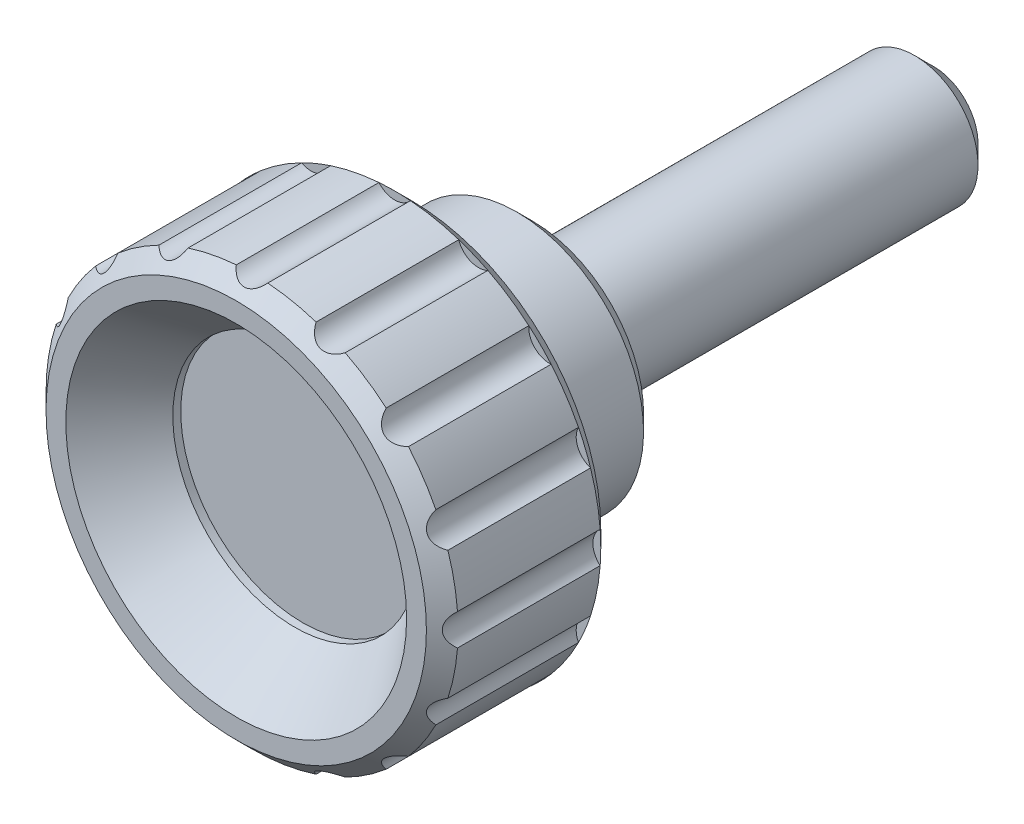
ISO-10303-21;
HEADER;
FILE_DESCRIPTION(('STEP AP214'),'2;1');
FILE_NAME('part.step','',(''),(''),'','','');
FILE_SCHEMA(('AUTOMOTIVE_DESIGN { 1 0 10303 214 1 1 1 1 }'));
ENDSEC;
DATA;
#1=APPLICATION_CONTEXT('core data for automotive mechanical design processes');
#2=APPLICATION_PROTOCOL_DEFINITION('international standard','automotive_design',2000,#1);
#3=PRODUCT_CONTEXT('',#1,'mechanical');
#4=PRODUCT('Part','Part','',(#3));
#5=PRODUCT_RELATED_PRODUCT_CATEGORY('part','',(#4));
#6=PRODUCT_DEFINITION_FORMATION('','',#4);
#7=PRODUCT_DEFINITION_CONTEXT('part definition',#1,'design');
#8=PRODUCT_DEFINITION('design','',#6,#7);
#9=PRODUCT_DEFINITION_SHAPE('','',#8);
#10=(LENGTH_UNIT() NAMED_UNIT(*) SI_UNIT(.MILLI.,.METRE.));
#11=(NAMED_UNIT(*) PLANE_ANGLE_UNIT() SI_UNIT($,.RADIAN.));
#12=(NAMED_UNIT(*) SI_UNIT($,.STERADIAN.) SOLID_ANGLE_UNIT());
#13=UNCERTAINTY_MEASURE_WITH_UNIT(LENGTH_MEASURE(1.E-05),#10,'distance_accuracy_value','');
#14=(GEOMETRIC_REPRESENTATION_CONTEXT(3) GLOBAL_UNCERTAINTY_ASSIGNED_CONTEXT((#13)) GLOBAL_UNIT_ASSIGNED_CONTEXT((#10,
#11,#12)) REPRESENTATION_CONTEXT('',''));
#15=CARTESIAN_POINT('',(0.,0.,0.));
#16=DIRECTION('',(0.,0.,1.));
#17=DIRECTION('',(1.,0.,0.));
#18=AXIS2_PLACEMENT_3D('',#15,#16,#17);
#19=CARTESIAN_POINT('',(-6.39920215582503E-13,-5.50485583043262E-13,7.99999999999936));
#20=DIRECTION('',(0.,0.,1.));
#21=DIRECTION('',(1.,0.,0.));
#22=AXIS2_PLACEMENT_3D('',#19,#20,#21);
#23=CYLINDRICAL_SURFACE('',#22,12.9999999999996);
#24=CARTESIAN_POINT('',(-1.43982048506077E-12,-1.23859256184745E-12,18.));
#25=DIRECTION('',(0.,0.,1.));
#26=DIRECTION('',(1.,0.,0.));
#27=AXIS2_PLACEMENT_3D('',#24,#25,#26);
#28=CIRCLE('',#27,12.9999999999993);
#29=CARTESIAN_POINT('',(-4.04215376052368,-12.3556057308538,17.9999999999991));
#30=VERTEX_POINT('',#29);
#31=CARTESIAN_POINT('',(-0.993822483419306,-12.9619565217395,17.9999999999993));
#32=VERTEX_POINT('',#31);
#33=EDGE_CURVE('E410',#30,#32,#28,.T.);
#34=ORIENTED_EDGE('',*,*,#33,.F.);
#35=DIRECTION('',(0.,0.,1.));
#36=VECTOR('',#35,1.);
#37=CARTESIAN_POINT('',(-4.04215376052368,-12.3556057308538,14.));
#38=LINE('',#37,#36);
#39=CARTESIAN_POINT('',(-4.04215376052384,-12.3556057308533,9.));
#40=VERTEX_POINT('',#39);
#41=EDGE_CURVE('E616',#30,#40,#38,.F.);
#42=ORIENTED_EDGE('',*,*,#41,.T.);
#43=CARTESIAN_POINT('',(-7.19910242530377E-13,-6.19296280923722E-13,9.));
#44=DIRECTION('',(0.,0.,1.));
#45=DIRECTION('',(1.,0.,0.));
#46=AXIS2_PLACEMENT_3D('',#43,#44,#45);
#47=CIRCLE('',#46,13.);
#48=CARTESIAN_POINT('',(-0.993822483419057,-12.9619565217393,9.));
#49=VERTEX_POINT('',#48);
#50=EDGE_CURVE('E474',#40,#49,#47,.T.);
#51=ORIENTED_EDGE('',*,*,#50,.T.);
#52=DIRECTION('',(0.,0.,1.));
#53=VECTOR('',#52,1.);
#54=CARTESIAN_POINT('',(-0.993822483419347,-12.9619565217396,14.));
#55=LINE('',#54,#53);
#56=EDGE_CURVE('E584',#49,#32,#55,.T.);
#57=ORIENTED_EDGE('',*,*,#56,.T.);
#58=EDGE_LOOP('',(#34,#42,#51,#57));
#59=FACE_BOUND('',#58,.T.);
#60=ADVANCED_FACE('F14',(#59),#23,.T.);
#61=CARTESIAN_POINT('',(-8.46274873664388,-9.86822597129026,9.));
#62=VERTEX_POINT('',#61);
#63=CARTESIAN_POINT('',(-5.87849826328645,-11.59496693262,9.));
#64=VERTEX_POINT('',#63);
#65=EDGE_CURVE('E484',#62,#64,#47,.T.);
#66=ORIENTED_EDGE('',*,*,#65,.T.);
#67=DIRECTION('',(0.,0.,1.));
#68=VECTOR('',#67,1.);
#69=CARTESIAN_POINT('',(-5.87849826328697,-11.5949669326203,14.));
#70=LINE('',#69,#68);
#71=CARTESIAN_POINT('',(-5.87849826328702,-11.5949669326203,17.999999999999));
#72=VERTEX_POINT('',#71);
#73=EDGE_CURVE('E614',#64,#72,#70,.T.);
#74=ORIENTED_EDGE('',*,*,#73,.T.);
#75=CARTESIAN_POINT('',(-8.46274873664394,-9.86822597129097,17.9999999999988));
#76=VERTEX_POINT('',#75);
#77=EDGE_CURVE('E406',#76,#72,#28,.T.);
#78=ORIENTED_EDGE('',*,*,#77,.F.);
#79=DIRECTION('',(0.,0.,1.));
#80=VECTOR('',#79,1.);
#81=CARTESIAN_POINT('',(-8.46274873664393,-9.8682259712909,14.));
#82=LINE('',#81,#80);
#83=EDGE_CURVE('E612',#76,#62,#82,.F.);
#84=ORIENTED_EDGE('',*,*,#83,.T.);
#85=EDGE_LOOP('',(#66,#74,#78,#84));
#86=FACE_BOUND('',#85,.T.);
#87=ADVANCED_FACE('F343',(#86),#23,.T.);
#88=CARTESIAN_POINT('',(-11.5949669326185,-5.87849826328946,9.));
#89=VERTEX_POINT('',#88);
#90=CARTESIAN_POINT('',(-9.868225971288,-8.46274873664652,9.));
#91=VERTEX_POINT('',#90);
#92=EDGE_CURVE('E494',#89,#91,#47,.T.);
#93=ORIENTED_EDGE('',*,*,#92,.T.);
#94=DIRECTION('',(0.,0.,1.));
#95=VECTOR('',#94,1.);
#96=CARTESIAN_POINT('',(-9.86822597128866,-8.46274873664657,14.));
#97=LINE('',#96,#95);
#98=CARTESIAN_POINT('',(-9.86822597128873,-8.46274873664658,17.9999999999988));
#99=VERTEX_POINT('',#98);
#100=EDGE_CURVE('E610',#91,#99,#97,.T.);
#101=ORIENTED_EDGE('',*,*,#100,.T.);
#102=CARTESIAN_POINT('',(-11.5949669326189,-5.87849826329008,17.9999999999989));
#103=VERTEX_POINT('',#102);
#104=EDGE_CURVE('E402',#103,#99,#28,.T.);
#105=ORIENTED_EDGE('',*,*,#104,.F.);
#106=DIRECTION('',(0.,0.,1.));
#107=VECTOR('',#106,1.);
#108=CARTESIAN_POINT('',(-11.5949669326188,-5.87849826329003,14.));
#109=LINE('',#108,#107);
#110=EDGE_CURVE('E608',#103,#89,#109,.F.);
#111=ORIENTED_EDGE('',*,*,#110,.T.);
#112=EDGE_LOOP('',(#93,#101,#105,#111));
#113=FACE_BOUND('',#112,.T.);
#114=ADVANCED_FACE('F349',(#113),#23,.T.);
#115=CARTESIAN_POINT('',(-12.9619565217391,-0.993822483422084,9.));
#116=VERTEX_POINT('',#115);
#117=CARTESIAN_POINT('',(-12.3556057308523,-4.04215376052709,9.));
#118=VERTEX_POINT('',#117);
#119=EDGE_CURVE('E505',#116,#118,#47,.T.);
#120=ORIENTED_EDGE('',*,*,#119,.T.);
#121=DIRECTION('',(0.,0.,1.));
#122=VECTOR('',#121,1.);
#123=CARTESIAN_POINT('',(-12.3556057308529,-4.04215376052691,14.));
#124=LINE('',#123,#122);
#125=CARTESIAN_POINT('',(-12.3556057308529,-4.0421537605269,17.999999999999));
#126=VERTEX_POINT('',#125);
#127=EDGE_CURVE('E606',#118,#126,#124,.T.);
#128=ORIENTED_EDGE('',*,*,#127,.T.);
#129=CARTESIAN_POINT('',(-12.9619565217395,-0.993822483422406,17.9999999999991));
#130=VERTEX_POINT('',#129);
#131=EDGE_CURVE('E398',#130,#126,#28,.T.);
#132=ORIENTED_EDGE('',*,*,#131,.F.);
#133=DIRECTION('',(0.,0.,1.));
#134=VECTOR('',#133,1.);
#135=CARTESIAN_POINT('',(-12.9619565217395,-0.993822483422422,14.));
#136=LINE('',#135,#134);
#137=EDGE_CURVE('E604',#130,#116,#136,.F.);
#138=ORIENTED_EDGE('',*,*,#137,.T.);
#139=EDGE_LOOP('',(#120,#128,#132,#138));
#140=FACE_BOUND('',#139,.T.);
#141=ADVANCED_FACE('F1087',(#140),#23,.T.);
#142=CARTESIAN_POINT('',(-12.3556057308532,4.04215376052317,9.));
#143=VERTEX_POINT('',#142);
#144=CARTESIAN_POINT('',(-12.9619565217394,0.993822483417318,9.));
#145=VERTEX_POINT('',#144);
#146=EDGE_CURVE('E516',#143,#145,#47,.T.);
#147=ORIENTED_EDGE('',*,*,#146,.T.);
#148=DIRECTION('',(0.,0.,1.));
#149=VECTOR('',#148,1.);
#150=CARTESIAN_POINT('',(-12.9619565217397,0.993822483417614,14.));
#151=LINE('',#150,#149);
#152=CARTESIAN_POINT('',(-12.9619565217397,0.993822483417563,17.9999999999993));
#153=VERTEX_POINT('',#152);
#154=EDGE_CURVE('E602',#145,#153,#151,.T.);
#155=ORIENTED_EDGE('',*,*,#154,.T.);
#156=CARTESIAN_POINT('',(-12.3556057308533,4.04215376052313,17.9999999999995));
#157=VERTEX_POINT('',#156);
#158=EDGE_CURVE('E394',#157,#153,#28,.T.);
#159=ORIENTED_EDGE('',*,*,#158,.F.);
#160=DIRECTION('',(0.,0.,1.));
#161=VECTOR('',#160,1.);
#162=CARTESIAN_POINT('',(-12.3556057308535,4.04215376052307,14.));
#163=LINE('',#162,#161);
#164=EDGE_CURVE('E600',#157,#143,#163,.F.);
#165=ORIENTED_EDGE('',*,*,#164,.T.);
#166=EDGE_LOOP('',(#147,#155,#159,#165));
#167=FACE_BOUND('',#166,.T.);
#168=ADVANCED_FACE('F1079',(#167),#23,.T.);
#169=CARTESIAN_POINT('',(-9.86822597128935,8.46274873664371,9.));
#170=VERTEX_POINT('',#169);
#171=CARTESIAN_POINT('',(-11.5949669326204,5.8784982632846,9.));
#172=VERTEX_POINT('',#171);
#173=EDGE_CURVE('E527',#170,#172,#47,.T.);
#174=ORIENTED_EDGE('',*,*,#173,.T.);
#175=DIRECTION('',(0.,0.,1.));
#176=VECTOR('',#175,1.);
#177=CARTESIAN_POINT('',(-11.5949669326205,5.87849826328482,14.));
#178=LINE('',#177,#176);
#179=CARTESIAN_POINT('',(-11.5949669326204,5.8784982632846,17.9999999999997));
#180=VERTEX_POINT('',#179);
#181=EDGE_CURVE('E598',#172,#180,#178,.T.);
#182=ORIENTED_EDGE('',*,*,#181,.T.);
#183=CARTESIAN_POINT('',(-9.86822597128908,8.46274873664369,18.));
#184=VERTEX_POINT('',#183);
#185=EDGE_CURVE('E390',#184,#180,#28,.T.);
#186=ORIENTED_EDGE('',*,*,#185,.F.);
#187=DIRECTION('',(0.,0.,1.));
#188=VECTOR('',#187,1.);
#189=CARTESIAN_POINT('',(-9.86822597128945,8.46274873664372,14.));
#190=LINE('',#189,#188);
#191=EDGE_CURVE('E596',#184,#170,#190,.F.);
#192=ORIENTED_EDGE('',*,*,#191,.T.);
#193=EDGE_LOOP('',(#174,#182,#186,#192));
#194=FACE_BOUND('',#193,.T.);
#195=ADVANCED_FACE('F1071',(#194),#23,.T.);
#196=CARTESIAN_POINT('',(-5.87849826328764,11.5949669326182,9.));
#197=VERTEX_POINT('',#196);
#198=CARTESIAN_POINT('',(-8.4627487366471,9.86822597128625,9.));
#199=VERTEX_POINT('',#198);
#200=EDGE_CURVE('E538',#197,#199,#47,.T.);
#201=ORIENTED_EDGE('',*,*,#200,.T.);
#202=DIRECTION('',(0.,0.,1.));
#203=VECTOR('',#202,1.);
#204=CARTESIAN_POINT('',(-8.4627487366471,9.86822597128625,14.));
#205=LINE('',#204,#203);
#206=CARTESIAN_POINT('',(-8.46274873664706,9.86822597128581,18.));
#207=VERTEX_POINT('',#206);
#208=EDGE_CURVE('E594',#199,#207,#205,.T.);
#209=ORIENTED_EDGE('',*,*,#208,.T.);
#210=CARTESIAN_POINT('',(-5.878498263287,11.5949669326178,18.0000000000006));
#211=VERTEX_POINT('',#210);
#212=EDGE_CURVE('E386',#211,#207,#28,.T.);
#213=ORIENTED_EDGE('',*,*,#212,.F.);
#214=DIRECTION('',(0.,0.,1.));
#215=VECTOR('',#214,1.);
#216=CARTESIAN_POINT('',(-5.87849826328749,11.5949669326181,14.));
#217=LINE('',#216,#215);
#218=EDGE_CURVE('E592',#211,#197,#217,.F.);
#219=ORIENTED_EDGE('',*,*,#218,.T.);
#220=EDGE_LOOP('',(#201,#209,#213,#219));
#221=FACE_BOUND('',#220,.T.);
#222=ADVANCED_FACE('F1063',(#221),#23,.T.);
#223=CARTESIAN_POINT('',(-0.993822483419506,12.961956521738,9.));
#224=VERTEX_POINT('',#223);
#225=CARTESIAN_POINT('',(-4.04215376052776,12.3556057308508,9.));
#226=VERTEX_POINT('',#225);
#227=EDGE_CURVE('E266',#224,#226,#47,.T.);
#228=ORIENTED_EDGE('',*,*,#227,.T.);
#229=DIRECTION('',(0.,0.,1.));
#230=VECTOR('',#229,1.);
#231=CARTESIAN_POINT('',(-4.04215376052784,12.3556057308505,14.));
#232=LINE('',#231,#230);
#233=CARTESIAN_POINT('',(-4.04215376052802,12.3556057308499,18.0000000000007));
#234=VERTEX_POINT('',#233);
#235=EDGE_CURVE('E558',#226,#234,#232,.T.);
#236=ORIENTED_EDGE('',*,*,#235,.T.);
#237=CARTESIAN_POINT('',(-0.993822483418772,12.9619565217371,18.0000000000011));
#238=VERTEX_POINT('',#237);
#239=EDGE_CURVE('E383',#238,#234,#28,.T.);
#240=ORIENTED_EDGE('',*,*,#239,.F.);
#241=DIRECTION('',(0.,0.,1.));
#242=VECTOR('',#241,1.);
#243=CARTESIAN_POINT('',(-0.993822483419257,12.9619565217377,14.));
#244=LINE('',#243,#242);
#245=EDGE_CURVE('E559',#238,#224,#244,.F.);
#246=ORIENTED_EDGE('',*,*,#245,.T.);
#247=EDGE_LOOP('',(#228,#236,#240,#246));
#248=FACE_BOUND('',#247,.T.);
#249=ADVANCED_FACE('F557',(#248),#23,.T.);
#250=CARTESIAN_POINT('',(0.993822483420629,-12.9619565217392,17.9999999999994));
#251=VERTEX_POINT('',#250);
#252=CARTESIAN_POINT('',(4.0421537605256,-12.3556057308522,17.9999999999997));
#253=VERTEX_POINT('',#252);
#254=EDGE_CURVE('E413',#251,#253,#28,.T.);
#255=ORIENTED_EDGE('',*,*,#254,.F.);
#256=DIRECTION('',(0.,0.,1.));
#257=VECTOR('',#256,1.);
#258=CARTESIAN_POINT('',(0.99382248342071,-12.9619565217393,14.));
#259=LINE('',#258,#257);
#260=CARTESIAN_POINT('',(0.993822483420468,-12.961956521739,9.));
#261=VERTEX_POINT('',#260);
#262=EDGE_CURVE('E586',#251,#261,#259,.F.);
#263=ORIENTED_EDGE('',*,*,#262,.T.);
#264=CARTESIAN_POINT('',(4.0421537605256,-12.3556057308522,9.));
#265=VERTEX_POINT('',#264);
#266=EDGE_CURVE('E463',#261,#265,#47,.T.);
#267=ORIENTED_EDGE('',*,*,#266,.T.);
#268=DIRECTION('',(0.,0.,1.));
#269=VECTOR('',#268,1.);
#270=CARTESIAN_POINT('',(4.04215376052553,-12.3556057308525,14.));
#271=LINE('',#270,#269);
#272=EDGE_CURVE('E580',#265,#253,#271,.T.);
#273=ORIENTED_EDGE('',*,*,#272,.T.);
#274=EDGE_LOOP('',(#255,#263,#267,#273));
#275=FACE_BOUND('',#274,.T.);
#276=ADVANCED_FACE('F1048',(#275),#23,.T.);
#277=CARTESIAN_POINT('',(5.87849826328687,-11.5949669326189,18.));
#278=VERTEX_POINT('',#277);
#279=CARTESIAN_POINT('',(8.46274873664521,-9.8682259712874,18.));
#280=VERTEX_POINT('',#279);
#281=EDGE_CURVE('E416',#278,#280,#28,.T.);
#282=ORIENTED_EDGE('',*,*,#281,.F.);
#283=DIRECTION('',(0.,0.,1.));
#284=VECTOR('',#283,1.);
#285=CARTESIAN_POINT('',(5.87849826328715,-11.5949669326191,14.));
#286=LINE('',#285,#284);
#287=CARTESIAN_POINT('',(5.87849826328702,-11.594966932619,9.));
#288=VERTEX_POINT('',#287);
#289=EDGE_CURVE('E582',#278,#288,#286,.F.);
#290=ORIENTED_EDGE('',*,*,#289,.T.);
#291=CARTESIAN_POINT('',(8.46274873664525,-9.86822597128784,9.));
#292=VERTEX_POINT('',#291);
#293=EDGE_CURVE('E453',#288,#292,#47,.T.);
#294=ORIENTED_EDGE('',*,*,#293,.T.);
#295=DIRECTION('',(0.,0.,1.));
#296=VECTOR('',#295,1.);
#297=CARTESIAN_POINT('',(8.46274873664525,-9.86822597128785,14.));
#298=LINE('',#297,#296);
#299=EDGE_CURVE('E577',#292,#280,#298,.T.);
#300=ORIENTED_EDGE('',*,*,#299,.T.);
#301=EDGE_LOOP('',(#282,#290,#294,#300));
#302=FACE_BOUND('',#301,.T.);
#303=ADVANCED_FACE('F1033',(#302),#23,.T.);
#304=CARTESIAN_POINT('',(9.86822597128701,-8.46274873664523,18.0000000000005));
#305=VERTEX_POINT('',#304);
#306=CARTESIAN_POINT('',(11.5949669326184,-5.87849826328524,18.0000000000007));
#307=VERTEX_POINT('',#306);
#308=EDGE_CURVE('E420',#305,#307,#28,.T.);
#309=ORIENTED_EDGE('',*,*,#308,.F.);
#310=DIRECTION('',(0.,0.,1.));
#311=VECTOR('',#310,1.);
#312=CARTESIAN_POINT('',(9.86822597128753,-8.46274873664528,14.));
#313=LINE('',#312,#311);
#314=CARTESIAN_POINT('',(9.86822597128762,-8.46274873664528,9.));
#315=VERTEX_POINT('',#314);
#316=EDGE_CURVE('E43',#305,#315,#313,.F.);
#317=ORIENTED_EDGE('',*,*,#316,.T.);
#318=CARTESIAN_POINT('',(11.5949669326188,-5.87849826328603,9.));
#319=VERTEX_POINT('',#318);
#320=EDGE_CURVE('E444',#315,#319,#47,.T.);
#321=ORIENTED_EDGE('',*,*,#320,.T.);
#322=DIRECTION('',(0.,0.,1.));
#323=VECTOR('',#322,1.);
#324=CARTESIAN_POINT('',(11.5949669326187,-5.87849826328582,14.));
#325=LINE('',#324,#323);
#326=EDGE_CURVE('E568',#319,#307,#325,.T.);
#327=ORIENTED_EDGE('',*,*,#326,.T.);
#328=EDGE_LOOP('',(#309,#317,#321,#327));
#329=FACE_BOUND('',#328,.T.);
#330=ADVANCED_FACE('F1027',(#329),#23,.T.);
#331=CARTESIAN_POINT('',(12.3556057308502,-4.04215376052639,18.0000000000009));
#332=VERTEX_POINT('',#331);
#333=CARTESIAN_POINT('',(12.961956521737,-0.993822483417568,18.0000000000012));
#334=VERTEX_POINT('',#333);
#335=EDGE_CURVE('E423',#332,#334,#28,.T.);
#336=ORIENTED_EDGE('',*,*,#335,.F.);
#337=DIRECTION('',(0.,0.,1.));
#338=VECTOR('',#337,1.);
#339=CARTESIAN_POINT('',(12.3556057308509,-4.04215376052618,14.));
#340=LINE('',#339,#338);
#341=CARTESIAN_POINT('',(12.3556057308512,-4.04215376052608,9.));
#342=VERTEX_POINT('',#341);
#343=EDGE_CURVE('E35',#332,#342,#340,.F.);
#344=ORIENTED_EDGE('',*,*,#343,.T.);
#345=CARTESIAN_POINT('',(12.961956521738,-0.993822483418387,9.));
#346=VERTEX_POINT('',#345);
#347=EDGE_CURVE('E434',#342,#346,#47,.T.);
#348=ORIENTED_EDGE('',*,*,#347,.T.);
#349=DIRECTION('',(0.,0.,1.));
#350=VECTOR('',#349,1.);
#351=CARTESIAN_POINT('',(12.9619565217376,-0.993822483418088,14.));
#352=LINE('',#351,#350);
#353=EDGE_CURVE('E569',#346,#334,#352,.T.);
#354=ORIENTED_EDGE('',*,*,#353,.T.);
#355=EDGE_LOOP('',(#336,#344,#348,#354));
#356=FACE_BOUND('',#355,.T.);
#357=ADVANCED_FACE('F1032',(#356),#23,.T.);
#358=CARTESIAN_POINT('',(12.9619565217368,0.993822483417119,18.0000000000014));
#359=VERTEX_POINT('',#358);
#360=CARTESIAN_POINT('',(12.3556057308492,4.04215376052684,18.0000000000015));
#361=VERTEX_POINT('',#360);
#362=EDGE_CURVE('E274',#359,#361,#28,.T.);
#363=ORIENTED_EDGE('',*,*,#362,.F.);
#364=DIRECTION('',(0.,0.,1.));
#365=VECTOR('',#364,1.);
#366=CARTESIAN_POINT('',(12.9619565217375,0.993822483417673,14.));
#367=LINE('',#366,#365);
#368=CARTESIAN_POINT('',(12.9619565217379,0.993822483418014,9.));
#369=VERTEX_POINT('',#368);
#370=EDGE_CURVE('E566',#359,#369,#367,.F.);
#371=ORIENTED_EDGE('',*,*,#370,.T.);
#372=CARTESIAN_POINT('',(12.3556057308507,4.04215376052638,9.));
#373=VERTEX_POINT('',#372);
#374=EDGE_CURVE('E267',#369,#373,#47,.T.);
#375=ORIENTED_EDGE('',*,*,#374,.T.);
#376=DIRECTION('',(0.,0.,1.));
#377=VECTOR('',#376,1.);
#378=CARTESIAN_POINT('',(12.3556057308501,4.04215376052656,14.));
#379=LINE('',#378,#377);
#380=EDGE_CURVE('E565',#373,#361,#379,.T.);
#381=ORIENTED_EDGE('',*,*,#380,.T.);
#382=EDGE_LOOP('',(#363,#371,#375,#381));
#383=FACE_BOUND('',#382,.T.);
#384=ADVANCED_FACE('F372',(#383),#23,.T.);
#385=CARTESIAN_POINT('',(11.594966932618,5.87849826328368,18.0000000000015));
#386=VERTEX_POINT('',#385);
#387=CARTESIAN_POINT('',(9.86822597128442,8.46274873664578,18.0000000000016));
#388=VERTEX_POINT('',#387);
#389=EDGE_CURVE('E381',#386,#388,#28,.T.);
#390=ORIENTED_EDGE('',*,*,#389,.F.);
#391=DIRECTION('',(0.,0.,1.));
#392=VECTOR('',#391,1.);
#393=CARTESIAN_POINT('',(11.5949669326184,5.87849826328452,14.));
#394=LINE('',#393,#392);
#395=CARTESIAN_POINT('',(11.5949669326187,5.87849826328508,9.));
#396=VERTEX_POINT('',#395);
#397=EDGE_CURVE('E572',#386,#396,#394,.F.);
#398=ORIENTED_EDGE('',*,*,#397,.T.);
#399=CARTESIAN_POINT('',(9.86822597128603,8.46274873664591,9.));
#400=VERTEX_POINT('',#399);
#401=EDGE_CURVE('E1164',#396,#400,#47,.T.);
#402=ORIENTED_EDGE('',*,*,#401,.T.);
#403=DIRECTION('',(0.,0.,1.));
#404=VECTOR('',#403,1.);
#405=CARTESIAN_POINT('',(9.86822597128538,8.46274873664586,14.));
#406=LINE('',#405,#404);
#407=EDGE_CURVE('E258',#400,#388,#406,.T.);
#408=ORIENTED_EDGE('',*,*,#407,.T.);
#409=EDGE_LOOP('',(#390,#398,#402,#408));
#410=FACE_BOUND('',#409,.T.);
#411=ADVANCED_FACE('F362',(#410),#23,.T.);
#412=CARTESIAN_POINT('',(8.46274873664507,9.86822597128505,18.0000000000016));
#413=VERTEX_POINT('',#412);
#414=CARTESIAN_POINT('',(5.87849826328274,11.5949669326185,18.0000000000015));
#415=VERTEX_POINT('',#414);
#416=EDGE_CURVE('E377',#413,#415,#28,.T.);
#417=ORIENTED_EDGE('',*,*,#416,.F.);
#418=DIRECTION('',(0.,0.,1.));
#419=VECTOR('',#418,1.);
#420=CARTESIAN_POINT('',(8.46274873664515,9.86822597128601,14.));
#421=LINE('',#420,#419);
#422=CARTESIAN_POINT('',(8.46274873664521,9.86822597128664,9.));
#423=VERTEX_POINT('',#422);
#424=EDGE_CURVE('E378',#413,#423,#421,.F.);
#425=ORIENTED_EDGE('',*,*,#424,.T.);
#426=CARTESIAN_POINT('',(5.8784982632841,11.5949669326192,9.));
#427=VERTEX_POINT('',#426);
#428=EDGE_CURVE('E239',#423,#427,#47,.T.);
#429=ORIENTED_EDGE('',*,*,#428,.T.);
#430=DIRECTION('',(0.,0.,1.));
#431=VECTOR('',#430,1.);
#432=CARTESIAN_POINT('',(5.87849826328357,11.594966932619,14.));
#433=LINE('',#432,#431);
#434=EDGE_CURVE('E248',#427,#415,#433,.T.);
#435=ORIENTED_EDGE('',*,*,#434,.T.);
#436=EDGE_LOOP('',(#417,#425,#429,#435));
#437=FACE_BOUND('',#436,.T.);
#438=ADVANCED_FACE('F354',(#437),#23,.T.);
#439=CARTESIAN_POINT('',(10.2499999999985,-1.30740325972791E-12,19.0000000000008));
#440=DIRECTION('',(0.,0.,1.));
#441=DIRECTION('',(0.,-1.,0.));
#442=AXIS2_PLACEMENT_3D('',#439,#440,#441);
#443=PLANE('',#442);
#444=CARTESIAN_POINT('',(-1.51981051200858E-12,-1.30740325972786E-12,19.));
#445=DIRECTION('',(0.,0.,1.));
#446=DIRECTION('',(1.,0.,0.));
#447=AXIS2_PLACEMENT_3D('',#444,#445,#446);
#448=CIRCLE('',#447,11.9999999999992);
#449=CARTESIAN_POINT('',(11.9999999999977,-1.30740325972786E-12,19.000000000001));
#450=VERTEX_POINT('',#449);
#451=EDGE_CURVE('E426',#450,#450,#448,.T.);
#452=ORIENTED_EDGE('',*,*,#451,.T.);
#453=EDGE_LOOP('',(#452));
#454=FACE_BOUND('',#453,.T.);
#455=CARTESIAN_POINT('',(-1.51981051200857E-12,-1.30740325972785E-12,19.));
#456=DIRECTION('',(0.,0.,1.));
#457=DIRECTION('',(1.,0.,0.));
#458=AXIS2_PLACEMENT_3D('',#455,#456,#457);
#459=CIRCLE('',#458,10.75);
#460=CARTESIAN_POINT('',(10.7499999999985,-1.30740325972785E-12,19.0000000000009));
#461=VERTEX_POINT('',#460);
#462=EDGE_CURVE('E430',#461,#461,#459,.T.);
#463=ORIENTED_EDGE('',*,*,#462,.F.);
#464=EDGE_LOOP('',(#463));
#465=FACE_BOUND('',#464,.T.);
#466=ADVANCED_FACE('F361',(#454,#465),#443,.T.);
#467=CARTESIAN_POINT('',(7.,0.,0.30000000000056));
#468=DIRECTION('',(0.,0.,-1.));
#469=DIRECTION('',(0.,1.,0.));
#470=AXIS2_PLACEMENT_3D('',#467,#468,#469);
#471=PLANE('',#470);
#472=CARTESIAN_POINT('',(0.,0.,0.3));
#473=DIRECTION('',(0.,0.,-1.));
#474=DIRECTION('',(0.,1.,0.));
#475=AXIS2_PLACEMENT_3D('',#472,#473,#474);
#476=CIRCLE('',#475,7.);
#477=CARTESIAN_POINT('',(0.,6.99999999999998,0.300000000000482));
#478=VERTEX_POINT('',#477);
#479=EDGE_CURVE('E285',#478,#478,#476,.T.);
#480=ORIENTED_EDGE('',*,*,#479,.T.);
#481=EDGE_LOOP('',(#480));
#482=FACE_BOUND('',#481,.T.);
#483=CARTESIAN_POINT('',(0.,0.,0.3));
#484=DIRECTION('',(0.,0.,-1.));
#485=DIRECTION('',(-1.,0.,0.));
#486=AXIS2_PLACEMENT_3D('',#483,#484,#485);
#487=CIRCLE('',#486,4.8);
#488=CARTESIAN_POINT('',(-4.80000000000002,0.,0.299999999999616));
#489=VERTEX_POINT('',#488);
#490=EDGE_CURVE('E278',#489,#489,#487,.T.);
#491=ORIENTED_EDGE('',*,*,#490,.F.);
#492=EDGE_LOOP('',(#491));
#493=FACE_BOUND('',#492,.T.);
#494=ADVANCED_FACE('F369',(#482,#493),#471,.T.);
#495=CARTESIAN_POINT('',(11.4999999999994,-5.50485583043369E-13,8.00000000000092));
#496=DIRECTION('',(0.,0.,-1.));
#497=DIRECTION('',(0.,1.,0.));
#498=AXIS2_PLACEMENT_3D('',#495,#496,#497);
#499=PLANE('',#498);
#500=CARTESIAN_POINT('',(-6.39920215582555E-13,-5.50485583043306E-13,8.));
#501=DIRECTION('',(0.,0.,-1.));
#502=DIRECTION('',(0.,1.,0.));
#503=AXIS2_PLACEMENT_3D('',#500,#501,#502);
#504=CIRCLE('',#503,8.);
#505=CARTESIAN_POINT('',(-6.39920215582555E-13,7.99999999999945,8.00000000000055));
#506=VERTEX_POINT('',#505);
#507=EDGE_CURVE('E291',#506,#506,#504,.T.);
#508=ORIENTED_EDGE('',*,*,#507,.F.);
#509=EDGE_LOOP('',(#508));
#510=FACE_BOUND('',#509,.T.);
#511=CARTESIAN_POINT('',(-6.39920215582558E-13,-5.50485583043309E-13,8.));
#512=DIRECTION('',(0.,0.,1.));
#513=DIRECTION('',(1.,0.,0.));
#514=AXIS2_PLACEMENT_3D('',#511,#512,#513);
#515=CIRCLE('',#514,12.);
#516=CARTESIAN_POINT('',(11.9999999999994,-5.50485583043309E-13,8.00000000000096));
#517=VERTEX_POINT('',#516);
#518=EDGE_CURVE('E271',#517,#517,#515,.T.);
#519=ORIENTED_EDGE('',*,*,#518,.F.);
#520=EDGE_LOOP('',(#519));
#521=FACE_BOUND('',#520,.T.);
#522=ADVANCED_FACE('F633',(#510,#521),#499,.T.);
#523=CARTESIAN_POINT('',(0.,0.,0.3));
#524=DIRECTION('',(0.,0.,-1.));
#525=DIRECTION('',(0.,1.,0.));
#526=AXIS2_PLACEMENT_3D('',#523,#524,#525);
#527=CYLINDRICAL_SURFACE('',#526,8.);
#528=ORIENTED_EDGE('',*,*,#507,.T.);
#529=EDGE_LOOP('',(#528));
#530=FACE_BOUND('',#529,.T.);
#531=CARTESIAN_POINT('',(-1.03987035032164E-13,0.,1.3));
#532=DIRECTION('',(0.,0.,-1.));
#533=DIRECTION('',(0.,1.,0.));
#534=AXIS2_PLACEMENT_3D('',#531,#532,#533);
#535=CIRCLE('',#534,8.);
#536=CARTESIAN_POINT('',(-1.03987035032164E-13,7.99999999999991,1.30000000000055));
#537=VERTEX_POINT('',#536);
#538=EDGE_CURVE('E288',#537,#537,#535,.T.);
#539=ORIENTED_EDGE('',*,*,#538,.F.);
#540=EDGE_LOOP('',(#539));
#541=FACE_BOUND('',#540,.T.);
#542=ADVANCED_FACE('F636',(#530,#541),#527,.T.);
#543=CARTESIAN_POINT('',(0.,0.,0.3));
#544=DIRECTION('',(0.,0.,1.));
#545=DIRECTION('',(0.,-1.,0.));
#546=AXIS2_PLACEMENT_3D('',#543,#544,#545);
#547=CONICAL_SURFACE('',#546,7.,0.785398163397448);
#548=ORIENTED_EDGE('',*,*,#538,.T.);
#549=EDGE_LOOP('',(#548));
#550=FACE_BOUND('',#549,.T.);
#551=ORIENTED_EDGE('',*,*,#479,.F.);
#552=EDGE_LOOP('',(#551));
#553=FACE_BOUND('',#552,.T.);
#554=ADVANCED_FACE('F640',(#550,#553),#547,.T.);
#555=CARTESIAN_POINT('',(0.,0.,0.));
#556=DIRECTION('',(0.,0.,-1.));
#557=DIRECTION('',(-1.,0.,0.));
#558=AXIS2_PLACEMENT_3D('',#555,#556,#557);
#559=PLANE('',#558);
#560=CARTESIAN_POINT('',(0.,0.,0.));
#561=DIRECTION('',(0.,0.,-1.));
#562=DIRECTION('',(-1.,0.,0.));
#563=AXIS2_PLACEMENT_3D('',#560,#561,#562);
#564=CIRCLE('',#563,4.8);
#565=CARTESIAN_POINT('',(-4.8,0.,-3.83897919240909E-13));
#566=VERTEX_POINT('',#565);
#567=EDGE_CURVE('E279',#566,#566,#564,.T.);
#568=ORIENTED_EDGE('',*,*,#567,.T.);
#569=EDGE_LOOP('',(#568));
#570=FACE_BOUND('',#569,.T.);
#571=CARTESIAN_POINT('',(0.,0.,0.));
#572=DIRECTION('',(0.,0.,-1.));
#573=DIRECTION('',(-1.,0.,0.));
#574=AXIS2_PLACEMENT_3D('',#571,#572,#573);
#575=CIRCLE('',#574,4.);
#576=CARTESIAN_POINT('',(-4.,0.,-3.19905897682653E-13));
#577=VERTEX_POINT('',#576);
#578=EDGE_CURVE('E282',#577,#577,#575,.T.);
#579=ORIENTED_EDGE('',*,*,#578,.F.);
#580=EDGE_LOOP('',(#579));
#581=FACE_BOUND('',#580,.T.);
#582=ADVANCED_FACE('F644',(#570,#581),#559,.T.);
#583=CARTESIAN_POINT('',(0.,0.,0.));
#584=DIRECTION('',(0.,0.,1.));
#585=DIRECTION('',(1.,0.,0.));
#586=AXIS2_PLACEMENT_3D('',#583,#584,#585);
#587=CYLINDRICAL_SURFACE('',#586,4.8);
#588=ORIENTED_EDGE('',*,*,#567,.F.);
#589=EDGE_LOOP('',(#588));
#590=FACE_BOUND('',#589,.T.);
#591=ORIENTED_EDGE('',*,*,#490,.T.);
#592=EDGE_LOOP('',(#591));
#593=FACE_BOUND('',#592,.T.);
#594=ADVANCED_FACE('F655',(#590,#593),#587,.T.);
#595=CARTESIAN_POINT('',(1.99975067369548E-12,1.72026744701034E-12,-25.));
#596=DIRECTION('',(0.,0.,-1.));
#597=DIRECTION('',(-1.,0.,0.));
#598=AXIS2_PLACEMENT_3D('',#595,#596,#597);
#599=PLANE('',#598);
#600=CARTESIAN_POINT('',(1.99975067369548E-12,1.72026744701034E-12,-25.));
#601=DIRECTION('',(0.,0.,-1.));
#602=DIRECTION('',(-1.,0.,0.));
#603=AXIS2_PLACEMENT_3D('',#600,#601,#602);
#604=CIRCLE('',#603,2.8);
#605=CARTESIAN_POINT('',(-2.799999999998,1.72026744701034E-12,-25.0000000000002));
#606=VERTEX_POINT('',#605);
#607=EDGE_CURVE('E297',#606,#606,#604,.T.);
#608=ORIENTED_EDGE('',*,*,#607,.T.);
#609=EDGE_LOOP('',(#608));
#610=FACE_BOUND('',#609,.T.);
#611=ADVANCED_FACE('F652',(#610),#599,.T.);
#612=CARTESIAN_POINT('',(1.99975067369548E-12,1.72026744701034E-12,-25.));
#613=DIRECTION('',(0.,0.,1.));
#614=DIRECTION('',(1.,0.,0.));
#615=AXIS2_PLACEMENT_3D('',#612,#613,#614);
#616=CONICAL_SURFACE('',#615,2.8,0.785398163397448);
#617=CARTESIAN_POINT('',(1.9037626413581E-12,1.63769460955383E-12,-23.8));
#618=DIRECTION('',(0.,0.,-1.));
#619=DIRECTION('',(-1.,0.,0.));
#620=AXIS2_PLACEMENT_3D('',#617,#618,#619);
#621=CIRCLE('',#620,4.);
#622=CARTESIAN_POINT('',(-3.9999999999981,1.63769460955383E-12,-23.8000000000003));
#623=VERTEX_POINT('',#622);
#624=EDGE_CURVE('E300',#623,#623,#621,.F.);
#625=ORIENTED_EDGE('',*,*,#624,.F.);
#626=EDGE_LOOP('',(#625));
#627=FACE_BOUND('',#626,.T.);
#628=ORIENTED_EDGE('',*,*,#607,.F.);
#629=EDGE_LOOP('',(#628));
#630=FACE_BOUND('',#629,.T.);
#631=ADVANCED_FACE('F16',(#627,#630),#616,.T.);
#632=CARTESIAN_POINT('',(0.,0.,0.));
#633=DIRECTION('',(0.,0.,1.));
#634=DIRECTION('',(1.,0.,0.));
#635=AXIS2_PLACEMENT_3D('',#632,#633,#634);
#636=CYLINDRICAL_SURFACE('',#635,4.);
#637=ORIENTED_EDGE('',*,*,#578,.T.);
#638=EDGE_LOOP('',(#637));
#639=FACE_BOUND('',#638,.T.);
#640=ORIENTED_EDGE('',*,*,#624,.T.);
#641=EDGE_LOOP('',(#640));
#642=FACE_BOUND('',#641,.T.);
#643=ADVANCED_FACE('F359',(#639,#642),#636,.T.);
#644=CARTESIAN_POINT('',(-6.39920215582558E-13,-5.50485583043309E-13,8.));
#645=DIRECTION('',(0.,0.,1.));
#646=DIRECTION('',(1.,0.,0.));
#647=AXIS2_PLACEMENT_3D('',#644,#645,#646);
#648=CONICAL_SURFACE('',#647,12.,0.785398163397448);
#649=ORIENTED_EDGE('',*,*,#374,.F.);
#650=EDGE_CURVE('E273',#346,#369,#47,.T.);
#651=ORIENTED_EDGE('',*,*,#650,.F.);
#652=ORIENTED_EDGE('',*,*,#347,.F.);
#653=EDGE_CURVE('E440',#319,#342,#47,.T.);
#654=ORIENTED_EDGE('',*,*,#653,.F.);
#655=ORIENTED_EDGE('',*,*,#320,.F.);
#656=EDGE_CURVE('E449',#292,#315,#47,.T.);
#657=ORIENTED_EDGE('',*,*,#656,.F.);
#658=ORIENTED_EDGE('',*,*,#293,.F.);
#659=EDGE_CURVE('E458',#265,#288,#47,.T.);
#660=ORIENTED_EDGE('',*,*,#659,.F.);
#661=ORIENTED_EDGE('',*,*,#266,.F.);
#662=EDGE_CURVE('E469',#49,#261,#47,.T.);
#663=ORIENTED_EDGE('',*,*,#662,.F.);
#664=ORIENTED_EDGE('',*,*,#50,.F.);
#665=EDGE_CURVE('E480',#64,#40,#47,.T.);
#666=ORIENTED_EDGE('',*,*,#665,.F.);
#667=ORIENTED_EDGE('',*,*,#65,.F.);
#668=EDGE_CURVE('E490',#91,#62,#47,.T.);
#669=ORIENTED_EDGE('',*,*,#668,.F.);
#670=ORIENTED_EDGE('',*,*,#92,.F.);
#671=EDGE_CURVE('E500',#118,#89,#47,.T.);
#672=ORIENTED_EDGE('',*,*,#671,.F.);
#673=ORIENTED_EDGE('',*,*,#119,.F.);
#674=EDGE_CURVE('E511',#145,#116,#47,.T.);
#675=ORIENTED_EDGE('',*,*,#674,.F.);
#676=ORIENTED_EDGE('',*,*,#146,.F.);
#677=EDGE_CURVE('E522',#172,#143,#47,.T.);
#678=ORIENTED_EDGE('',*,*,#677,.F.);
#679=ORIENTED_EDGE('',*,*,#173,.F.);
#680=EDGE_CURVE('E533',#199,#170,#47,.T.);
#681=ORIENTED_EDGE('',*,*,#680,.F.);
#682=ORIENTED_EDGE('',*,*,#200,.F.);
#683=EDGE_CURVE('E544',#226,#197,#47,.T.);
#684=ORIENTED_EDGE('',*,*,#683,.F.);
#685=ORIENTED_EDGE('',*,*,#227,.F.);
#686=CARTESIAN_POINT('',(0.993822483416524,12.9619565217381,9.));
#687=VERTEX_POINT('',#686);
#688=EDGE_CURVE('E265',#687,#224,#47,.T.);
#689=ORIENTED_EDGE('',*,*,#688,.F.);
#690=CARTESIAN_POINT('',(4.04215376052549,12.355605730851,9.));
#691=VERTEX_POINT('',#690);
#692=EDGE_CURVE('E240',#691,#687,#47,.T.);
#693=ORIENTED_EDGE('',*,*,#692,.F.);
#694=EDGE_CURVE('E231',#427,#691,#47,.T.);
#695=ORIENTED_EDGE('',*,*,#694,.F.);
#696=ORIENTED_EDGE('',*,*,#428,.F.);
#697=EDGE_CURVE('E1167',#400,#423,#47,.T.);
#698=ORIENTED_EDGE('',*,*,#697,.F.);
#699=ORIENTED_EDGE('',*,*,#401,.F.);
#700=EDGE_CURVE('E272',#373,#396,#47,.T.);
#701=ORIENTED_EDGE('',*,*,#700,.F.);
#702=EDGE_LOOP('',(#649,#651,#652,#654,#655,#657,#658,#660,#661,#663,#664,#666,#667,#669,#670,
#672,#673,#675,#676,#678,#679,#681,#682,#684,#685,#689,#693,#695,#696,#698,#699,#701));
#703=FACE_BOUND('',#702,.T.);
#704=ORIENTED_EDGE('',*,*,#518,.T.);
#705=EDGE_LOOP('',(#704));
#706=FACE_BOUND('',#705,.T.);
#707=ADVANCED_FACE('F262',(#703,#706),#648,.T.);
#708=ORIENTED_EDGE('',*,*,#692,.T.);
#709=DIRECTION('',(0.,0.,1.));
#710=VECTOR('',#709,1.);
#711=CARTESIAN_POINT('',(0.993822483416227,12.9619565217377,14.));
#712=LINE('',#711,#710);
#713=CARTESIAN_POINT('',(0.993822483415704,12.9619565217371,18.0000000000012));
#714=VERTEX_POINT('',#713);
#715=EDGE_CURVE('E588',#687,#714,#712,.T.);
#716=ORIENTED_EDGE('',*,*,#715,.T.);
#717=CARTESIAN_POINT('',(4.04215376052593,12.3556057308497,18.0000000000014));
#718=VERTEX_POINT('',#717);
#719=EDGE_CURVE('E257',#718,#714,#28,.T.);
#720=ORIENTED_EDGE('',*,*,#719,.F.);
#721=DIRECTION('',(0.,0.,1.));
#722=VECTOR('',#721,1.);
#723=CARTESIAN_POINT('',(4.04215376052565,12.3556057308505,14.));
#724=LINE('',#723,#722);
#725=EDGE_CURVE('E245',#718,#691,#724,.F.);
#726=ORIENTED_EDGE('',*,*,#725,.T.);
#727=EDGE_LOOP('',(#708,#716,#720,#726));
#728=FACE_BOUND('',#727,.T.);
#729=ADVANCED_FACE('F254',(#728),#23,.T.);
#730=CARTESIAN_POINT('',(-1.43982048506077E-12,-1.23859256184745E-12,18.));
#731=DIRECTION('',(0.,0.,-1.));
#732=DIRECTION('',(-1.,0.,0.));
#733=AXIS2_PLACEMENT_3D('',#730,#731,#732);
#734=CONICAL_SURFACE('',#733,12.9999999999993,0.785398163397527);
#735=ORIENTED_EDGE('',*,*,#451,.F.);
#736=EDGE_LOOP('',(#735));
#737=FACE_BOUND('',#736,.T.);
#738=ORIENTED_EDGE('',*,*,#77,.T.);
#739=CARTESIAN_POINT('',(-5.87871711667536,-11.5950802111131,17.9997999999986));
#740=CARTESIAN_POINT('',(-5.84928597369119,-11.5798521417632,18.0266898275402));
#741=CARTESIAN_POINT('',(-5.81895371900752,-11.5655672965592,18.0531049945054));
#742=CARTESIAN_POINT('',(-5.756371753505,-11.5390770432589,18.1048217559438));
#743=CARTESIAN_POINT('',(-5.72411817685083,-11.5268760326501,18.130120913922));
#744=CARTESIAN_POINT('',(-5.62378947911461,-11.4935463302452,18.2044510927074));
#745=CARTESIAN_POINT('',(-5.55276752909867,-11.4760237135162,18.2513352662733));
#746=CARTESIAN_POINT('',(-5.42531861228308,-11.4564586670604,18.3239368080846));
#747=CARTESIAN_POINT('',(-5.37060424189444,-11.4514062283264,18.3518558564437));
#748=CARTESIAN_POINT('',(-5.25848601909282,-11.4485329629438,18.4016637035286));
#749=CARTESIAN_POINT('',(-5.20109495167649,-11.4506806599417,18.4235782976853));
#750=CARTESIAN_POINT('',(-5.09393831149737,-11.4621269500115,18.4570191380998));
#751=CARTESIAN_POINT('',(-5.04439157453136,-11.4702488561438,18.4696366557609));
#752=CARTESIAN_POINT('',(-4.94543096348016,-11.4925807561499,18.4886362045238));
#753=CARTESIAN_POINT('',(-4.89601708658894,-11.5067906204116,18.4950183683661));
#754=CARTESIAN_POINT('',(-4.79873736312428,-11.5412079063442,18.5010119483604));
#755=CARTESIAN_POINT('',(-4.75087591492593,-11.5614309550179,18.5006055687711));
#756=CARTESIAN_POINT('',(-4.65835169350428,-11.6071997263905,18.4930150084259));
#757=CARTESIAN_POINT('',(-4.61368935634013,-11.632746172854,18.4858299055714));
#758=CARTESIAN_POINT('',(-4.53038775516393,-11.6870353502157,18.4656900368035));
#759=CARTESIAN_POINT('',(-4.49158013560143,-11.7156116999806,18.452974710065));
#760=CARTESIAN_POINT('',(-4.41848432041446,-11.775752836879,18.4226654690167));
#761=CARTESIAN_POINT('',(-4.38419765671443,-11.8073186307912,18.4050699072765));
#762=CARTESIAN_POINT('',(-4.30512735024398,-11.8880598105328,18.3565675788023));
#763=CARTESIAN_POINT('',(-4.26307152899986,-11.9384900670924,18.3233046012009));
#764=CARTESIAN_POINT('',(-4.18858929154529,-12.0419659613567,18.2504718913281));
#765=CARTESIAN_POINT('',(-4.1561932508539,-12.0950192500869,18.2108828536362));
#766=CARTESIAN_POINT('',(-4.11040101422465,-12.1828671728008,18.1424390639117));
#767=CARTESIAN_POINT('',(-4.09436816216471,-12.2173373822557,18.1148701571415));
#768=CARTESIAN_POINT('',(-4.06572380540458,-12.2864807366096,18.0583181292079));
#769=CARTESIAN_POINT('',(-4.0531088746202,-12.3211536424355,18.0293364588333));
#770=CARTESIAN_POINT('',(-4.04207910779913,-12.355840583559,17.9997999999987));
#771=B_SPLINE_CURVE_WITH_KNOTS('',3,(#739,#740,#741,#742,#743,#744,#745,#746,#747,#748,#749,
#750,#751,#752,#753,#754,#755,#756,#757,#758,#759,#760,#761,#762,#763,#764,#765,#766,#767,#768,
#769,#770),.UNSPECIFIED.,.F.,.F.,(4,2,2,2,2,2,2,2,2,2,2,2,2,2,2,4),(0.,0.127963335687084,
0.256193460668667,0.515365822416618,0.699649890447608,0.883129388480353,1.0377778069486,
1.19242293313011,1.34747351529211,1.50254519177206,1.65148353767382,1.80047222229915,
2.02008153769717,2.24037431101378,2.38112116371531,2.521726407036),.UNSPECIFIED.);
#772=EDGE_CURVE('E9',#72,#30,#771,.T.);
#773=ORIENTED_EDGE('',*,*,#772,.T.);
#774=ORIENTED_EDGE('',*,*,#33,.T.);
#775=CARTESIAN_POINT('',(-0.993981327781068,-12.962144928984,17.9998000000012));
#776=CARTESIAN_POINT('',(-0.972618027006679,-12.9368132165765,18.0266898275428));
#777=CARTESIAN_POINT('',(-0.950061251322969,-12.9120080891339,18.0531049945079));
#778=CARTESIAN_POINT('',(-0.902380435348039,-12.8635852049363,18.104821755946));
#779=CARTESIAN_POINT('',(-0.877251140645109,-12.8399700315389,18.1301209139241));
#780=CARTESIAN_POINT('',(-0.797314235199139,-12.7707832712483,18.2044510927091));
#781=CARTESIAN_POINT('',(-0.738404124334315,-12.7274155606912,18.2513352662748));
#782=CARTESIAN_POINT('',(-0.628143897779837,-12.6605672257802,18.3239368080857));
#783=CARTESIAN_POINT('',(-0.579527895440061,-12.6349610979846,18.3518558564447));
#784=CARTESIAN_POINT('',(-0.477043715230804,-12.589400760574,18.4016637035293));
#785=CARTESIAN_POINT('',(-0.423199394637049,-12.5694223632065,18.4235782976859));
#786=CARTESIAN_POINT('',(-0.319819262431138,-12.5389902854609,18.4570191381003));
#787=CARTESIAN_POINT('',(-0.270935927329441,-12.527533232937,18.4696366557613));
#788=CARTESIAN_POINT('',(-0.170962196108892,-12.5102946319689,18.4886362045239));
#789=CARTESIAN_POINT('',(-0.119871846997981,-12.5045129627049,18.4950183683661));
#790=CARTESIAN_POINT('',(-0.0168261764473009,-12.4990830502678,18.5010119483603));
#791=CARTESIAN_POINT('',(0.0351310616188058,-12.499450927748,18.5006055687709));
#792=CARTESIAN_POINT('',(0.138127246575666,-12.5063282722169,18.4930150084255));
#793=CARTESIAN_POINT('',(0.189166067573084,-12.5128385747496,18.485829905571));
#794=CARTESIAN_POINT('',(0.286902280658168,-12.5311170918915,18.4656900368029));
#795=CARTESIAN_POINT('',(0.333691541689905,-12.5426671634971,18.4529747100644));
#796=CARTESIAN_POINT('',(0.424238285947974,-12.5702577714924,18.4226654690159));
#797=CARTESIAN_POINT('',(0.467994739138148,-12.5862998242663,18.4050699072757));
#798=CARTESIAN_POINT('',(0.571944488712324,-12.6306360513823,18.3565675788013));
#799=CARTESIAN_POINT('',(0.630097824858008,-12.6611334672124,18.3233046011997));
#800=CARTESIAN_POINT('',(0.738508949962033,-12.7282296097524,18.2504718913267));
#801=CARTESIAN_POINT('',(0.788741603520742,-12.764847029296,18.2108828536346));
#802=CARTESIAN_POINT('',(0.864666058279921,-12.8284839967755,18.1424390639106));
#803=CARTESIAN_POINT('',(0.892669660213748,-12.8541948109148,18.1148701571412));
#804=CARTESIAN_POINT('',(0.945593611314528,-12.9071132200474,18.058318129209));
#805=CARTESIAN_POINT('',(0.97051703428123,-12.9343192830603,18.0293364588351));
#806=CARTESIAN_POINT('',(0.993981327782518,-12.9621449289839,17.9998000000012));
#807=B_SPLINE_CURVE_WITH_KNOTS('',3,(#775,#776,#777,#778,#779,#780,#781,#782,#783,#784,#785,
#786,#787,#788,#789,#790,#791,#792,#793,#794,#795,#796,#797,#798,#799,#800,#801,#802,#803,#804,
#805,#806),.UNSPECIFIED.,.F.,.F.,(4,2,2,2,2,2,2,2,2,2,2,2,2,2,2,4),(0.,0.127963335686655,
0.256193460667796,0.515365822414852,0.699649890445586,0.883129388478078,1.03777780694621,
1.19242293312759,1.34747351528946,1.50254519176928,1.65148353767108,1.80047222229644,
2.02008153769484,2.24037431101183,2.38112116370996,2.52172640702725),.UNSPECIFIED.);
#808=EDGE_CURVE('E1180',#32,#251,#807,.T.);
#809=ORIENTED_EDGE('',*,*,#808,.T.);
#810=ORIENTED_EDGE('',*,*,#254,.T.);
#811=CARTESIAN_POINT('',(4.04207910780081,-12.3558405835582,17.9997999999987));
#812=CARTESIAN_POINT('',(4.05212219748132,-12.3242617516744,18.0266898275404));
#813=CARTESIAN_POINT('',(4.0634694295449,-12.292712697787,18.0531049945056));
#814=CARTESIAN_POINT('',(4.08899012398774,-12.2297291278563,18.1048217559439));
#815=CARTESIAN_POINT('',(4.10316942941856,-12.1982949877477,18.1301209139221));
#816=CARTESIAN_POINT('',(4.15054487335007,-12.1037842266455,18.2044510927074));
#817=CARTESIAN_POINT('',(4.18837461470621,-12.041173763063,18.2513352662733));
#818=CARTESIAN_POINT('',(4.26466003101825,-11.9372191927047,18.3239368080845));
#819=CARTESIAN_POINT('',(4.29977631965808,-11.8949576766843,18.3518558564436));
#820=CARTESIAN_POINT('',(4.37702416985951,-11.8136464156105,18.4016637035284));
#821=CARTESIAN_POINT('',(4.41912443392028,-11.774583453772,18.423578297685));
#822=CARTESIAN_POINT('',(4.50298937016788,-11.70690601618,18.4570191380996));
#823=CARTESIAN_POINT('',(4.54376725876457,-11.6776142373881,18.4696366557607));
#824=CARTESIAN_POINT('',(4.62953401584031,-11.6234295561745,18.4886362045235));
#825=CARTESIAN_POINT('',(4.67452279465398,-11.5985365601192,18.4950183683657));
#826=CARTESIAN_POINT('',(4.76764664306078,-11.5540861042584,18.50101194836));
#827=CARTESIAN_POINT('',(4.81578965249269,-11.5345428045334,18.5006055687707));
#828=CARTESIAN_POINT('',(4.91357756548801,-11.5014817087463,18.4930150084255));
#829=CARTESIAN_POINT('',(4.96322267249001,-11.4879647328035,18.485829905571));
#830=CARTESIAN_POINT('',(5.06051404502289,-11.4674498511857,18.4656900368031));
#831=CARTESIAN_POINT('',(5.10816170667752,-11.4602152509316,18.4529747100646));
#832=CARTESIAN_POINT('',(5.20237445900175,-11.4510549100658,18.4226654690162));
#833=CARTESIAN_POINT('',(5.24893917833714,-11.4491309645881,18.4050699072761));
#834=CARTESIAN_POINT('',(5.36194296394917,-11.4503124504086,18.3565675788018));
#835=CARTESIAN_POINT('',(5.42734049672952,-11.4562340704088,18.3233046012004));
#836=CARTESIAN_POINT('',(5.55317589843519,-11.4767356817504,18.2504718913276));
#837=CARTESIAN_POINT('',(5.61359769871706,-11.4913425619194,18.2108828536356));
#838=CARTESIAN_POINT('',(5.70809556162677,-11.5210804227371,18.1424390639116));
#839=CARTESIAN_POINT('',(5.74380661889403,-11.534117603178,18.1148701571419));
#840=CARTESIAN_POINT('',(5.81295297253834,-11.5627547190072,18.0583181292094));
#841=CARTESIAN_POINT('',(5.84639052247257,-11.578352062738,18.0293364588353));
#842=CARTESIAN_POINT('',(5.87871711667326,-11.5950802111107,17.9998000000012));
#843=B_SPLINE_CURVE_WITH_KNOTS('',3,(#811,#812,#813,#814,#815,#816,#817,#818,#819,#820,#821,
#822,#823,#824,#825,#826,#827,#828,#829,#830,#831,#832,#833,#834,#835,#836,#837,#838,#839,#840,
#841,#842),.UNSPECIFIED.,.F.,.F.,(4,2,2,2,2,2,2,2,2,2,2,2,2,2,2,4),(0.,0.127963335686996,
0.256193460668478,0.515365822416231,0.699649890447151,0.883129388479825,1.03777780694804,
1.19242293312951,1.34747351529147,1.50254519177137,1.65148353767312,1.80047222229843,
2.02008153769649,2.24037431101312,2.38112116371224,2.5217264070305),.UNSPECIFIED.);
#844=EDGE_CURVE('E1133',#253,#278,#843,.T.);
#845=ORIENTED_EDGE('',*,*,#844,.T.);
#846=ORIENTED_EDGE('',*,*,#281,.T.);
#847=CARTESIAN_POINT('',(8.46276964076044,-9.86847151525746,17.9997999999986));
#848=CARTESIAN_POINT('',(8.45996354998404,-9.83545315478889,18.0266898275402));
#849=CARTESIAN_POINT('',(8.45837372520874,-9.8019632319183,18.0531049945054));
#850=CARTESIAN_POINT('',(8.45784900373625,-9.73400765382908,18.1048217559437));
#851=CARTESIAN_POINT('',(8.45891964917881,-9.6995401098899,18.1301209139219));
#852=CARTESIAN_POINT('',(8.46652114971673,-9.59409375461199,18.2044510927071));
#853=CARTESIAN_POINT('',(8.47751128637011,-9.52177241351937,18.251335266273));
#854=CARTESIAN_POINT('',(8.50820812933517,-9.39653774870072,18.3239368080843));
#855=CARTESIAN_POINT('',(8.52447856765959,-9.3440547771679,18.3518558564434));
#856=CARTESIAN_POINT('',(8.56472980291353,-9.23937149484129,18.4016637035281));
#857=CARTESIAN_POINT('',(8.58867662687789,-9.18717095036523,18.4235782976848));
#858=CARTESIAN_POINT('',(8.64025869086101,-9.09255142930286,18.4570191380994));
#859=CARTESIAN_POINT('',(8.66672306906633,-9.04988433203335,18.4696366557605));
#860=CARTESIAN_POINT('',(8.72522564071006,-8.96700269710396,18.4886362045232));
#861=CARTESIAN_POINT('',(8.75726371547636,-8.92678810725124,18.4950183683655));
#862=CARTESIAN_POINT('',(8.82628847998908,-8.85008428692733,18.5010119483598));
#863=CARTESIAN_POINT('',(8.86328792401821,-8.81360510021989,18.5006055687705));
#864=CARTESIAN_POINT('',(8.940980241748,-8.74563881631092,18.4930150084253));
#865=CARTESIAN_POINT('',(8.98167361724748,-8.71415239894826,18.4858299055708));
#866=CARTESIAN_POINT('',(9.06370841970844,-8.65796732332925,18.4656900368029));
#867=CARTESIAN_POINT('',(9.10496055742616,-8.63304945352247,18.4529747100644));
#868=CARTESIAN_POINT('',(9.18849628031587,-8.58853274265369,18.4226654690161));
#869=CARTESIAN_POINT('',(9.23078020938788,-8.56893570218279,18.405069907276));
#870=CARTESIAN_POINT('',(9.3356342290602,-8.52678257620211,18.3565675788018));
#871=CARTESIAN_POINT('',(9.39831977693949,-8.50722688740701,18.3233046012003));
#872=CARTESIAN_POINT('',(9.52242215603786,-8.47801278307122,18.2504718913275));
#873=CARTESIAN_POINT('',(9.58383443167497,-8.46838535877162,18.2108828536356));
#874=CARTESIAN_POINT('',(9.6825192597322,-8.4596967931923,18.1424390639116));
#875=CARTESIAN_POINT('',(9.72050108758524,-8.45807554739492,18.1148701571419));
#876=CARTESIAN_POINT('',(9.79534293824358,-8.45807162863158,18.0583181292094));
#877=CARTESIAN_POINT('',(9.83220405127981,-8.45968569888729,18.0293364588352));
#878=CARTESIAN_POINT('',(9.868471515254,-8.4627696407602,17.9998000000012));
#879=B_SPLINE_CURVE_WITH_KNOTS('',3,(#847,#848,#849,#850,#851,#852,#853,#854,#855,#856,#857,
#858,#859,#860,#861,#862,#863,#864,#865,#866,#867,#868,#869,#870,#871,#872,#873,#874,#875,#876,
#877,#878),.UNSPECIFIED.,.F.,.F.,(4,2,2,2,2,2,2,2,2,2,2,2,2,2,2,4),(0.,0.127963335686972,
0.256193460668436,0.515365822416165,0.699649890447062,0.883129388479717,1.0377778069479,
1.19242293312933,1.34747351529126,1.50254519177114,1.65148353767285,1.80047222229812,
2.02008153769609,2.24037431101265,2.38112116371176,2.52172640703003),.UNSPECIFIED.);
#880=EDGE_CURVE('E1207',#280,#305,#879,.T.);
#881=ORIENTED_EDGE('',*,*,#880,.T.);
#882=ORIENTED_EDGE('',*,*,#308,.T.);
#883=CARTESIAN_POINT('',(11.5950802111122,-5.87871711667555,17.9997999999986));
#884=CARTESIAN_POINT('',(11.5798521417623,-5.8492859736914,18.0266898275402));
#885=CARTESIAN_POINT('',(11.5655672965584,-5.81895371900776,18.0531049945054));
#886=CARTESIAN_POINT('',(11.5390770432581,-5.7563717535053,18.1048217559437));
#887=CARTESIAN_POINT('',(11.5268760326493,-5.72411817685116,18.1301209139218));
#888=CARTESIAN_POINT('',(11.4935463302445,-5.62378947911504,18.2044510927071));
#889=CARTESIAN_POINT('',(11.4760237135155,-5.55276752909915,18.2513352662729));
#890=CARTESIAN_POINT('',(11.4564586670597,-5.42531861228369,18.3239368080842));
#891=CARTESIAN_POINT('',(11.4514062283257,-5.3706042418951,18.3518558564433));
#892=CARTESIAN_POINT('',(11.4485329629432,-5.25848601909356,18.401663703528));
#893=CARTESIAN_POINT('',(11.4506806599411,-5.20109495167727,18.4235782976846));
#894=CARTESIAN_POINT('',(11.4621269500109,-5.09393831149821,18.4570191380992));
#895=CARTESIAN_POINT('',(11.4702488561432,-5.04439157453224,18.4696366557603));
#896=CARTESIAN_POINT('',(11.4925807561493,-4.94543096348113,18.4886362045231));
#897=CARTESIAN_POINT('',(11.506790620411,-4.89601708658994,18.4950183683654));
#898=CARTESIAN_POINT('',(11.5412079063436,-4.79873736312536,18.5010119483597));
#899=CARTESIAN_POINT('',(11.5614309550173,-4.75087591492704,18.5006055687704));
#900=CARTESIAN_POINT('',(11.6071997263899,-4.65835169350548,18.4930150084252));
#901=CARTESIAN_POINT('',(11.6327461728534,-4.61368935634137,18.4858299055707));
#902=CARTESIAN_POINT('',(11.6870353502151,-4.53038775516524,18.4656900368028));
#903=CARTESIAN_POINT('',(11.7156116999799,-4.49158013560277,18.4529747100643));
#904=CARTESIAN_POINT('',(11.7757528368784,-4.41848432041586,18.4226654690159));
#905=CARTESIAN_POINT('',(11.8073186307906,-4.38419765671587,18.4050699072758));
#906=CARTESIAN_POINT('',(11.8880598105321,-4.30512735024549,18.3565675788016));
#907=CARTESIAN_POINT('',(11.9384900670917,-4.2630715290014,18.3233046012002));
#908=CARTESIAN_POINT('',(12.0419659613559,-4.18858929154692,18.2504718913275));
#909=CARTESIAN_POINT('',(12.0950192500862,-4.15619325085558,18.2108828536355));
#910=CARTESIAN_POINT('',(12.1828671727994,-4.11040101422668,18.1424390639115));
#911=CARTESIAN_POINT('',(12.2173373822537,-4.09436816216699,18.1148701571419));
#912=CARTESIAN_POINT('',(12.2864807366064,-4.06572380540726,18.0583181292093));
#913=CARTESIAN_POINT('',(12.3211536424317,-4.05310887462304,18.0293364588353));
#914=CARTESIAN_POINT('',(12.3558405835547,-4.04207910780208,17.9998000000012));
#915=B_SPLINE_CURVE_WITH_KNOTS('',3,(#883,#884,#885,#886,#887,#888,#889,#890,#891,#892,#893,
#894,#895,#896,#897,#898,#899,#900,#901,#902,#903,#904,#905,#906,#907,#908,#909,#910,#911,#912,
#913,#914),.UNSPECIFIED.,.F.,.F.,(4,2,2,2,2,2,2,2,2,2,2,2,2,2,2,4),(0.,0.127963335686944,
0.256193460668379,0.515365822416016,0.699649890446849,0.883129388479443,1.03777780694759,
1.19242293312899,1.34747351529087,1.50254519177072,1.65148353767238,1.80047222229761,
2.02008153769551,2.24037431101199,2.38112116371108,2.52172640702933),.UNSPECIFIED.);
#916=EDGE_CURVE('E1213',#307,#332,#915,.T.);
#917=ORIENTED_EDGE('',*,*,#916,.T.);
#918=ORIENTED_EDGE('',*,*,#335,.T.);
#919=CARTESIAN_POINT('',(12.9621449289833,-0.99398132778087,17.9998000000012));
#920=CARTESIAN_POINT('',(12.9368132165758,-0.972618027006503,18.0266898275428));
#921=CARTESIAN_POINT('',(12.9120080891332,-0.95006125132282,18.0531049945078));
#922=CARTESIAN_POINT('',(12.8635852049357,-0.902380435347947,18.1048217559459));
#923=CARTESIAN_POINT('',(12.8399700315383,-0.877251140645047,18.1301209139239));
#924=CARTESIAN_POINT('',(12.7707832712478,-0.797314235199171,18.2044510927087));
#925=CARTESIAN_POINT('',(12.7274155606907,-0.738404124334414,18.2513352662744));
#926=CARTESIAN_POINT('',(12.6605672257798,-0.628143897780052,18.3239368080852));
#927=CARTESIAN_POINT('',(12.6349610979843,-0.579527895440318,18.3518558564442));
#928=CARTESIAN_POINT('',(12.5894007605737,-0.477043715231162,18.4016637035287));
#929=CARTESIAN_POINT('',(12.5694223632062,-0.423199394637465,18.4235782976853));
#930=CARTESIAN_POINT('',(12.5389902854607,-0.319819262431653,18.4570191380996));
#931=CARTESIAN_POINT('',(12.5275332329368,-0.270935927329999,18.4696366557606));
#932=CARTESIAN_POINT('',(12.5102946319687,-0.170962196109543,18.4886362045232));
#933=CARTESIAN_POINT('',(12.5045129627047,-0.119871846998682,18.4950183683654));
#934=CARTESIAN_POINT('',(12.4990830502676,-0.0168261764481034,18.5010119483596));
#935=CARTESIAN_POINT('',(12.4994509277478,0.0351310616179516,18.5006055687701));
#936=CARTESIAN_POINT('',(12.5063282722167,0.138127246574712,18.4930150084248));
#937=CARTESIAN_POINT('',(12.5128385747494,0.189166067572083,18.4858299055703));
#938=CARTESIAN_POINT('',(12.5311170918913,0.286902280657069,18.4656900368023));
#939=CARTESIAN_POINT('',(12.5426671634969,0.333691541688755,18.4529747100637));
#940=CARTESIAN_POINT('',(12.5702577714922,0.424238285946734,18.4226654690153));
#941=CARTESIAN_POINT('',(12.5862998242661,0.467994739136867,18.4050699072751));
#942=CARTESIAN_POINT('',(12.630636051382,0.571944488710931,18.3565675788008));
#943=CARTESIAN_POINT('',(12.6611334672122,0.630097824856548,18.3233046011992));
#944=CARTESIAN_POINT('',(12.7282296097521,0.738508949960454,18.2504718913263));
#945=CARTESIAN_POINT('',(12.7648470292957,0.788741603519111,18.2108828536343));
#946=CARTESIAN_POINT('',(12.8284839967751,0.864666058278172,18.1424390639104));
#947=CARTESIAN_POINT('',(12.8541948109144,0.892669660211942,18.114870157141));
#948=CARTESIAN_POINT('',(12.9071132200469,0.945593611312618,18.0583181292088));
#949=CARTESIAN_POINT('',(12.9343192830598,0.970517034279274,18.029336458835));
#950=CARTESIAN_POINT('',(12.9621449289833,0.993981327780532,17.9998000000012));
#951=B_SPLINE_CURVE_WITH_KNOTS('',3,(#919,#920,#921,#922,#923,#924,#925,#926,#927,#928,#929,
#930,#931,#932,#933,#934,#935,#936,#937,#938,#939,#940,#941,#942,#943,#944,#945,#946,#947,#948,
#949,#950),.UNSPECIFIED.,.F.,.F.,(4,2,2,2,2,2,2,2,2,2,2,2,2,2,2,4),(0.,0.127963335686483,
0.256193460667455,0.515365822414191,0.699649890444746,0.883129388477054,1.03777780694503,
1.19242293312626,1.34747351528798,1.50254519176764,1.6514835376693,1.80047222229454,
2.0200815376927,2.24037431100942,2.38112116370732,2.52172640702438),.UNSPECIFIED.);
#952=EDGE_CURVE('E1253',#334,#359,#951,.T.);
#953=ORIENTED_EDGE('',*,*,#952,.T.);
#954=ORIENTED_EDGE('',*,*,#362,.T.);
#955=CARTESIAN_POINT('',(12.3558405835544,4.04207910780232,17.9998000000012));
#956=CARTESIAN_POINT('',(12.3242617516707,4.05212219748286,18.0266898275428));
#957=CARTESIAN_POINT('',(12.2927126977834,4.06346942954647,18.0531049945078));
#958=CARTESIAN_POINT('',(12.2297291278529,4.08899012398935,18.1048217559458));
#959=CARTESIAN_POINT('',(12.1982949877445,4.10316942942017,18.1301209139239));
#960=CARTESIAN_POINT('',(12.1037842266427,4.1505448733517,18.2044510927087));
#961=CARTESIAN_POINT('',(12.0411737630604,4.18837461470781,18.2513352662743));
#962=CARTESIAN_POINT('',(11.9372191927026,4.2646600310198,18.3239368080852));
#963=CARTESIAN_POINT('',(11.8949576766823,4.29977631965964,18.3518558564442));
#964=CARTESIAN_POINT('',(11.8136464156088,4.37702416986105,18.4016637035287));
#965=CARTESIAN_POINT('',(11.7745834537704,4.41912443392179,18.4235782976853));
#966=CARTESIAN_POINT('',(11.7069060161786,4.50298937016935,18.4570191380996));
#967=CARTESIAN_POINT('',(11.6776142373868,4.54376725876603,18.4696366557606));
#968=CARTESIAN_POINT('',(11.6234295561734,4.62953401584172,18.4886362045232));
#969=CARTESIAN_POINT('',(11.5985365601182,4.67452279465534,18.4950183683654));
#970=CARTESIAN_POINT('',(11.5540861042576,4.76764664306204,18.5010119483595));
#971=CARTESIAN_POINT('',(11.5345428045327,4.81578965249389,18.5006055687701));
#972=CARTESIAN_POINT('',(11.5014817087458,4.91357756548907,18.4930150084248));
#973=CARTESIAN_POINT('',(11.4879647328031,4.96322267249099,18.4858299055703));
#974=CARTESIAN_POINT('',(11.4674498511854,5.06051404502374,18.4656900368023));
#975=CARTESIAN_POINT('',(11.4602152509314,5.10816170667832,18.4529747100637));
#976=CARTESIAN_POINT('',(11.4510549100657,5.20237445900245,18.4226654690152));
#977=CARTESIAN_POINT('',(11.449130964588,5.24893917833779,18.4050699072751));
#978=CARTESIAN_POINT('',(11.4503124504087,5.36194296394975,18.3565675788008));
#979=CARTESIAN_POINT('',(11.456234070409,5.42734049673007,18.3233046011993));
#980=CARTESIAN_POINT('',(11.4767356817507,5.55317589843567,18.2504718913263));
#981=CARTESIAN_POINT('',(11.4913425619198,5.6135976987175,18.2108828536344));
#982=CARTESIAN_POINT('',(11.5210804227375,5.70809556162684,18.1424390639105));
#983=CARTESIAN_POINT('',(11.5341176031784,5.74380661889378,18.114870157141));
#984=CARTESIAN_POINT('',(11.5627547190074,5.81295297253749,18.0583181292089));
#985=CARTESIAN_POINT('',(11.5783520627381,5.84639052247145,18.029336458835));
#986=CARTESIAN_POINT('',(11.5950802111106,5.87871711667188,17.9998000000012));
#987=B_SPLINE_CURVE_WITH_KNOTS('',3,(#955,#956,#957,#958,#959,#960,#961,#962,#963,#964,#965,
#966,#967,#968,#969,#970,#971,#972,#973,#974,#975,#976,#977,#978,#979,#980,#981,#982,#983,#984,
#985,#986),.UNSPECIFIED.,.F.,.F.,(4,2,2,2,2,2,2,2,2,2,2,2,2,2,2,4),(0.,0.127963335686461,
0.256193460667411,0.515365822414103,0.699649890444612,0.883129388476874,1.03777780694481,
1.19242293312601,1.34747351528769,1.50254519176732,1.65148353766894,1.80047222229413,
2.02008153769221,2.24037431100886,2.38112116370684,2.52172640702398),.UNSPECIFIED.);
#988=EDGE_CURVE('E1261',#361,#386,#987,.T.);
#989=ORIENTED_EDGE('',*,*,#988,.T.);
#990=ORIENTED_EDGE('',*,*,#389,.T.);
#991=CARTESIAN_POINT('',(9.86847151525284,8.46276964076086,17.9998000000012));
#992=CARTESIAN_POINT('',(9.83545315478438,8.45996354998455,18.0266898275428));
#993=CARTESIAN_POINT('',(9.8019632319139,8.45837372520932,18.0531049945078));
#994=CARTESIAN_POINT('',(9.7340076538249,8.45784900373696,18.1048217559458));
#995=CARTESIAN_POINT('',(9.69954010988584,8.45891964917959,18.1301209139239));
#996=CARTESIAN_POINT('',(9.59409375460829,8.46652114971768,18.2044510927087));
#997=CARTESIAN_POINT('',(9.52177241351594,8.47751128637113,18.2513352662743));
#998=CARTESIAN_POINT('',(9.39653774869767,8.50820812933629,18.3239368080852));
#999=CARTESIAN_POINT('',(9.34405477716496,8.52447856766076,18.3518558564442));
#1000=CARTESIAN_POINT('',(9.23937149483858,8.56472980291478,18.4016637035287));
#1001=CARTESIAN_POINT('',(9.18717095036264,8.58867662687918,18.4235782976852));
#1002=CARTESIAN_POINT('',(9.09255142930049,8.64025869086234,18.4570191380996));
#1003=CARTESIAN_POINT('',(9.04988433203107,8.66672306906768,18.4696366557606));
#1004=CARTESIAN_POINT('',(8.96700269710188,8.72522564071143,18.4886362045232));
#1005=CARTESIAN_POINT('',(8.92678810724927,8.75726371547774,18.4950183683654));
#1006=CARTESIAN_POINT('',(8.85008428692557,8.82628847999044,18.5010119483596));
#1007=CARTESIAN_POINT('',(8.81360510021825,8.86328792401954,18.5006055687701));
#1008=CARTESIAN_POINT('',(8.7456388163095,8.94098024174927,18.4930150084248));
#1009=CARTESIAN_POINT('',(8.71415239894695,8.98167361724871,18.4858299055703));
#1010=CARTESIAN_POINT('',(8.65796732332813,9.06370841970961,18.4656900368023));
#1011=CARTESIAN_POINT('',(8.63304945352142,9.1049605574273,18.4529747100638));
#1012=CARTESIAN_POINT('',(8.58853274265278,9.18849628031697,18.4226654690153));
#1013=CARTESIAN_POINT('',(8.56893570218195,9.23078020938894,18.4050699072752));
#1014=CARTESIAN_POINT('',(8.52678257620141,9.33563422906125,18.3565675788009));
#1015=CARTESIAN_POINT('',(8.5072268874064,9.39831977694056,18.3233046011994));
#1016=CARTESIAN_POINT('',(8.4780127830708,9.52242215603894,18.2504718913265));
#1017=CARTESIAN_POINT('',(8.46838535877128,9.58383443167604,18.2108828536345));
#1018=CARTESIAN_POINT('',(8.45969679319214,9.68251925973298,18.1424390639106));
#1019=CARTESIAN_POINT('',(8.4580755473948,9.72050108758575,18.1148701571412));
#1020=CARTESIAN_POINT('',(8.45807162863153,9.79534293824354,18.058318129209));
#1021=CARTESIAN_POINT('',(8.45968569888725,9.83220405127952,18.029336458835));
#1022=CARTESIAN_POINT('',(8.46276964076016,9.86847151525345,17.9998000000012));
#1023=B_SPLINE_CURVE_WITH_KNOTS('',3,(#991,#992,#993,#994,#995,#996,#997,#998,#999,#1000,#1001,
#1002,#1003,#1004,#1005,#1006,#1007,#1008,#1009,#1010,#1011,#1012,#1013,#1014,#1015,#1016,#1017,
#1018,#1019,#1020,#1021,#1022),.UNSPECIFIED.,.F.,.F.,(4,2,2,2,2,2,2,2,2,2,2,2,2,2,2,4),(0.,
0.12796333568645,0.256193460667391,0.515365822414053,0.699649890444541,0.883129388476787,
1.0377778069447,1.19242293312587,1.34747351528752,1.50254519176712,1.6514835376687,
1.80047222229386,2.02008153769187,2.24037431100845,2.38112116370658,2.52172640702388),.UNSPECIFIED.);
#1024=EDGE_CURVE('E312',#388,#413,#1023,.T.);
#1025=ORIENTED_EDGE('',*,*,#1024,.T.);
#1026=ORIENTED_EDGE('',*,*,#416,.T.);
#1027=CARTESIAN_POINT('',(5.87871711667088,11.5950802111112,17.9998000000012));
#1028=CARTESIAN_POINT('',(5.8492859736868,11.5798521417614,18.0266898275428));
#1029=CARTESIAN_POINT('',(5.81895371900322,11.5655672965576,18.0531049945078));
#1030=CARTESIAN_POINT('',(5.7563717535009,11.5390770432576,18.1048217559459));
#1031=CARTESIAN_POINT('',(5.72411817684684,11.5268760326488,18.1301209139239));
#1032=CARTESIAN_POINT('',(5.62378947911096,11.4935463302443,18.2044510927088));
#1033=CARTESIAN_POINT('',(5.55276752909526,11.4760237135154,18.2513352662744));
#1034=CARTESIAN_POINT('',(5.42531861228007,11.4564586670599,18.3239368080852));
#1035=CARTESIAN_POINT('',(5.37060424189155,11.451406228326,18.3518558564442));
#1036=CARTESIAN_POINT('',(5.25848601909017,11.4485329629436,18.4016637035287));
#1037=CARTESIAN_POINT('',(5.20109495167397,11.4506806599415,18.4235782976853));
#1038=CARTESIAN_POINT('',(5.09393831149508,11.4621269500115,18.4570191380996));
#1039=CARTESIAN_POINT('',(5.04439157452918,11.4702488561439,18.4696366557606));
#1040=CARTESIAN_POINT('',(4.94543096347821,11.4925807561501,18.4886362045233));
#1041=CARTESIAN_POINT('',(4.89601708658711,11.5067906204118,18.4950183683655));
#1042=CARTESIAN_POINT('',(4.79873736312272,11.5412079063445,18.5010119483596));
#1043=CARTESIAN_POINT('',(4.7508759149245,11.5614309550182,18.5006055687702));
#1044=CARTESIAN_POINT('',(4.65835169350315,11.6071997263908,18.4930150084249));
#1045=CARTESIAN_POINT('',(4.61368935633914,11.6327461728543,18.4858299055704));
#1046=CARTESIAN_POINT('',(4.53038775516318,11.687035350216,18.4656900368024));
#1047=CARTESIAN_POINT('',(4.49158013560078,11.7156116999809,18.4529747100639));
#1048=CARTESIAN_POINT('',(4.41848432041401,11.7757528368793,18.4226654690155));
#1049=CARTESIAN_POINT('',(4.38419765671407,11.8073186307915,18.4050699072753));
#1050=CARTESIAN_POINT('',(4.30512735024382,11.8880598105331,18.3565675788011));
#1051=CARTESIAN_POINT('',(4.26307152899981,11.9384900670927,18.3233046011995));
#1052=CARTESIAN_POINT('',(4.18858929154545,12.041965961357,18.2504718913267));
#1053=CARTESIAN_POINT('',(4.15619325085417,12.0950192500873,18.2108828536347));
#1054=CARTESIAN_POINT('',(4.1104010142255,12.1828671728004,18.1424390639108));
#1055=CARTESIAN_POINT('',(4.09436816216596,12.2173373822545,18.1148701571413));
#1056=CARTESIAN_POINT('',(4.06572380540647,12.2864807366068,18.058318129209));
#1057=CARTESIAN_POINT('',(4.05310887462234,12.3211536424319,18.0293364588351));
#1058=CARTESIAN_POINT('',(4.04207910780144,12.3558405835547,17.9998000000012));
#1059=B_SPLINE_CURVE_WITH_KNOTS('',3,(#1027,#1028,#1029,#1030,#1031,#1032,#1033,#1034,#1035,
#1036,#1037,#1038,#1039,#1040,#1041,#1042,#1043,#1044,#1045,#1046,#1047,#1048,#1049,#1050,#1051,
#1052,#1053,#1054,#1055,#1056,#1057,#1058),.UNSPECIFIED.,.F.,.F.,(4,2,2,2,2,2,2,2,2,2,2,2,2,2,2,
4),(0.,0.127963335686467,0.256193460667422,0.515365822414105,0.699649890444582,
0.883129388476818,1.03777780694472,1.19242293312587,1.34747351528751,1.5025451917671,
1.65148353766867,1.80047222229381,2.02008153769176,2.2403743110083,2.3811211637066,
2.52172640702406),.UNSPECIFIED.);
#1060=EDGE_CURVE('E303',#415,#718,#1059,.T.);
#1061=ORIENTED_EDGE('',*,*,#1060,.T.);
#1062=ORIENTED_EDGE('',*,*,#719,.T.);
#1063=CARTESIAN_POINT('',(0.993981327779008,12.9621449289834,17.9998000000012));
#1064=CARTESIAN_POINT('',(0.972618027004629,12.936813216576,18.0266898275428));
#1065=CARTESIAN_POINT('',(0.950061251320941,12.9120080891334,18.0531049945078));
#1066=CARTESIAN_POINT('',(0.902380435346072,12.8635852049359,18.1048217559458));
#1067=CARTESIAN_POINT('',(0.877251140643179,12.8399700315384,18.1301209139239));
#1068=CARTESIAN_POINT('',(0.797314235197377,12.7707832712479,18.2044510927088));
#1069=CARTESIAN_POINT('',(0.73840412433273,12.7274155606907,18.2513352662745));
#1070=CARTESIAN_POINT('',(0.628143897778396,12.6605672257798,18.3239368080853));
#1071=CARTESIAN_POINT('',(0.579527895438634,12.6349610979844,18.3518558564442));
#1072=CARTESIAN_POINT('',(0.477043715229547,12.5894007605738,18.4016637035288));
#1073=CARTESIAN_POINT('',(0.423199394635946,12.5694223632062,18.4235782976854));
#1074=CARTESIAN_POINT('',(0.319819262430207,12.5389902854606,18.4570191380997));
#1075=CARTESIAN_POINT('',(0.270935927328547,12.5275332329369,18.4696366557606));
#1076=CARTESIAN_POINT('',(0.170962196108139,12.5102946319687,18.4886362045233));
#1077=CARTESIAN_POINT('',(0.119871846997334,12.5045129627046,18.4950183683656));
#1078=CARTESIAN_POINT('',(0.0168261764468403,12.4990830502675,18.5010119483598));
#1079=CARTESIAN_POINT('',(-0.0351310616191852,12.4994509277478,18.5006055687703));
#1080=CARTESIAN_POINT('',(-0.138127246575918,12.5063282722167,18.493015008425));
#1081=CARTESIAN_POINT('',(-0.18916606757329,12.5128385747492,18.4858299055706));
#1082=CARTESIAN_POINT('',(-0.286902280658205,12.5311170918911,18.4656900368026));
#1083=CARTESIAN_POINT('',(-0.333691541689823,12.5426671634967,18.4529747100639));
#1084=CARTESIAN_POINT('',(-0.424238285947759,12.570257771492,18.4226654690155));
#1085=CARTESIAN_POINT('',(-0.467994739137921,12.5862998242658,18.4050699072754));
#1086=CARTESIAN_POINT('',(-0.571944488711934,12.6306360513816,18.3565675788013));
#1087=CARTESIAN_POINT('',(-0.630097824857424,12.6611334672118,18.3233046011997));
#1088=CARTESIAN_POINT('',(-0.738508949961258,12.7282296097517,18.2504718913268));
#1089=CARTESIAN_POINT('',(-0.788741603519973,12.7648470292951,18.2108828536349));
#1090=CARTESIAN_POINT('',(-0.864666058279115,12.8284839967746,18.1424390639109));
#1091=CARTESIAN_POINT('',(-0.892669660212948,12.854194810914,18.1148701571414));
#1092=CARTESIAN_POINT('',(-0.94559361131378,12.9071132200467,18.058318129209));
#1093=CARTESIAN_POINT('',(-0.970517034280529,12.9343192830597,18.0293364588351));
#1094=CARTESIAN_POINT('',(-0.993981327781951,12.9621449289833,17.9998000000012));
#1095=B_SPLINE_CURVE_WITH_KNOTS('',3,(#1063,#1064,#1065,#1066,#1067,#1068,#1069,#1070,#1071,
#1072,#1073,#1074,#1075,#1076,#1077,#1078,#1079,#1080,#1081,#1082,#1083,#1084,#1085,#1086,#1087,
#1088,#1089,#1090,#1091,#1092,#1093,#1094),.UNSPECIFIED.,.F.,.F.,(4,2,2,2,2,2,2,2,2,2,2,2,2,2,2,
4),(0.,0.127963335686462,0.256193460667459,0.515365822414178,0.699649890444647,
0.883129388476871,1.03777780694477,1.19242293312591,1.34747351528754,1.50254519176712,
1.65148353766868,1.8004722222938,2.02008153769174,2.24037431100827,2.38112116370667,
2.52172640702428),.UNSPECIFIED.);
#1096=EDGE_CURVE('E1178',#714,#238,#1095,.T.);
#1097=ORIENTED_EDGE('',*,*,#1096,.T.);
#1098=ORIENTED_EDGE('',*,*,#239,.T.);
#1099=CARTESIAN_POINT('',(-4.04207910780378,12.3558405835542,17.9998000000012));
#1100=CARTESIAN_POINT('',(-4.05212219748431,12.3242617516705,18.0266898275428));
#1101=CARTESIAN_POINT('',(-4.06346942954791,12.2927126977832,18.0531049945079));
#1102=CARTESIAN_POINT('',(-4.08899012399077,12.2297291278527,18.104821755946));
#1103=CARTESIAN_POINT('',(-4.10316942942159,12.1982949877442,18.130120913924));
#1104=CARTESIAN_POINT('',(-4.15054487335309,12.1037842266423,18.204451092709));
#1105=CARTESIAN_POINT('',(-4.18837461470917,12.04117376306,18.2513352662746));
#1106=CARTESIAN_POINT('',(-4.26466003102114,11.9372191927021,18.3239368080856));
#1107=CARTESIAN_POINT('',(-4.29977631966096,11.8949576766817,18.3518558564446));
#1108=CARTESIAN_POINT('',(-4.37702416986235,11.8136464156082,18.4016637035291));
#1109=CARTESIAN_POINT('',(-4.41912443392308,11.7745834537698,18.4235782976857));
#1110=CARTESIAN_POINT('',(-4.50298937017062,11.706906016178,18.4570191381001));
#1111=CARTESIAN_POINT('',(-4.54376725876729,11.6776142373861,18.4696366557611));
#1112=CARTESIAN_POINT('',(-4.62953401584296,11.6234295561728,18.4886362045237));
#1113=CARTESIAN_POINT('',(-4.67452279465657,11.5985365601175,18.495018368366));
#1114=CARTESIAN_POINT('',(-4.76764664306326,11.5540861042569,18.5010119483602));
#1115=CARTESIAN_POINT('',(-4.8157896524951,11.534542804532,18.5006055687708));
#1116=CARTESIAN_POINT('',(-4.91357756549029,11.501481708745,18.4930150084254));
#1117=CARTESIAN_POINT('',(-4.9632226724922,11.4879647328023,18.485829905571));
#1118=CARTESIAN_POINT('',(-5.06051404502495,11.4674498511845,18.465690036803));
#1119=CARTESIAN_POINT('',(-5.10816170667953,11.4602152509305,18.4529747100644));
#1120=CARTESIAN_POINT('',(-5.20237445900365,11.4510549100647,18.422665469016));
#1121=CARTESIAN_POINT('',(-5.24893917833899,11.4491309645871,18.4050699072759));
#1122=CARTESIAN_POINT('',(-5.36194296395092,11.4503124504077,18.3565675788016));
#1123=CARTESIAN_POINT('',(-5.42734049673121,11.456234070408,18.3233046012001));
#1124=CARTESIAN_POINT('',(-5.55317589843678,11.4767356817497,18.2504718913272));
#1125=CARTESIAN_POINT('',(-5.61359769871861,11.4913425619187,18.2108828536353));
#1126=CARTESIAN_POINT('',(-5.70809556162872,11.5210804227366,18.1424390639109));
#1127=CARTESIAN_POINT('',(-5.74380661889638,11.5341176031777,18.1148701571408));
#1128=CARTESIAN_POINT('',(-5.81295297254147,11.5627547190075,18.0583181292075));
#1129=CARTESIAN_POINT('',(-5.84639052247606,11.5783520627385,18.029336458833));
#1130=CARTESIAN_POINT('',(-5.87871711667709,11.5950802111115,17.9997999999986));
#1131=B_SPLINE_CURVE_WITH_KNOTS('',3,(#1099,#1100,#1101,#1102,#1103,#1104,#1105,#1106,#1107,
#1108,#1109,#1110,#1111,#1112,#1113,#1114,#1115,#1116,#1117,#1118,#1119,#1120,#1121,#1122,#1123,
#1124,#1125,#1126,#1127,#1128,#1129,#1130),.UNSPECIFIED.,.F.,.F.,(4,2,2,2,2,2,2,2,2,2,2,2,2,2,2,
4),(0.,0.127963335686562,0.256193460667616,0.515365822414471,0.699649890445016,
0.883129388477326,1.03777780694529,1.19242293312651,1.3474735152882,1.50254519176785,
1.65148353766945,1.80047222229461,2.02008153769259,2.24037431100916,2.38112116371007,
2.52172640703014),.UNSPECIFIED.);
#1132=EDGE_CURVE('E1179',#234,#211,#1131,.T.);
#1133=ORIENTED_EDGE('',*,*,#1132,.T.);
#1134=ORIENTED_EDGE('',*,*,#212,.T.);
#1135=CARTESIAN_POINT('',(-8.462769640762,9.86847151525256,17.9998000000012));
#1136=CARTESIAN_POINT('',(-8.45996354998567,9.83545315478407,18.0266898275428));
#1137=CARTESIAN_POINT('',(-8.45837372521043,9.80196323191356,18.0531049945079));
#1138=CARTESIAN_POINT('',(-8.45784900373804,9.73400765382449,18.104821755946));
#1139=CARTESIAN_POINT('',(-8.45891964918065,9.6995401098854,18.1301209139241));
#1140=CARTESIAN_POINT('',(-8.4665211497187,9.59409375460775,18.204451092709));
#1141=CARTESIAN_POINT('',(-8.47751128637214,9.52177241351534,18.2513352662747));
#1142=CARTESIAN_POINT('',(-8.50820812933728,9.39653774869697,18.3239368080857));
#1143=CARTESIAN_POINT('',(-8.52447856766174,9.34405477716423,18.3518558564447));
#1144=CARTESIAN_POINT('',(-8.56472980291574,9.23937149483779,18.4016637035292));
#1145=CARTESIAN_POINT('',(-8.58867662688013,9.18717095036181,18.4235782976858));
#1146=CARTESIAN_POINT('',(-8.64025869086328,9.09255142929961,18.4570191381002));
#1147=CARTESIAN_POINT('',(-8.66672306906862,9.04988433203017,18.4696366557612));
#1148=CARTESIAN_POINT('',(-8.72522564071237,8.96700269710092,18.4886362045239));
#1149=CARTESIAN_POINT('',(-8.75726371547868,8.92678810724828,18.4950183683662));
#1150=CARTESIAN_POINT('',(-8.82628847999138,8.85008428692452,18.5010119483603));
#1151=CARTESIAN_POINT('',(-8.86328792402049,8.81360510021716,18.5006055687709));
#1152=CARTESIAN_POINT('',(-8.94098024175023,8.74563881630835,18.4930150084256));
#1153=CARTESIAN_POINT('',(-8.98167361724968,8.71415239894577,18.4858299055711));
#1154=CARTESIAN_POINT('',(-9.06370841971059,8.65796732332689,18.4656900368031));
#1155=CARTESIAN_POINT('',(-9.1049605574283,8.63304945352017,18.4529747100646));
#1156=CARTESIAN_POINT('',(-9.18849628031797,8.58853274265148,18.4226654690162));
#1157=CARTESIAN_POINT('',(-9.23078020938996,8.56893570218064,18.405069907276));
#1158=CARTESIAN_POINT('',(-9.33563422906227,8.52678257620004,18.3565675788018));
#1159=CARTESIAN_POINT('',(-9.39831977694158,8.507226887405,18.3233046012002));
#1160=CARTESIAN_POINT('',(-9.52242215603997,8.47801278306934,18.2504718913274));
#1161=CARTESIAN_POINT('',(-9.58383443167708,8.46838535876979,18.2108828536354));
#1162=CARTESIAN_POINT('',(-9.68251925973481,8.45969679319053,18.1424390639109));
#1163=CARTESIAN_POINT('',(-9.72050108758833,8.45807554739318,18.1148701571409));
#1164=CARTESIAN_POINT('',(-9.79534293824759,8.45807162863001,18.0583181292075));
#1165=CARTESIAN_POINT('',(-9.83220405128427,8.45968569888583,18.029336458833));
#1166=CARTESIAN_POINT('',(-9.86847151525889,8.46276964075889,17.9997999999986));
#1167=B_SPLINE_CURVE_WITH_KNOTS('',3,(#1135,#1136,#1137,#1138,#1139,#1140,#1141,#1142,#1143,
#1144,#1145,#1146,#1147,#1148,#1149,#1150,#1151,#1152,#1153,#1154,#1155,#1156,#1157,#1158,#1159,
#1160,#1161,#1162,#1163,#1164,#1165,#1166),.UNSPECIFIED.,.F.,.F.,(4,2,2,2,2,2,2,2,2,2,2,2,2,2,2,
4),(0.,0.1279633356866,0.256193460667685,0.515365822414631,0.69964989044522,0.883129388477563,
1.03777780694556,1.1924229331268,1.34747351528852,1.5025451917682,1.65148353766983,
1.80047222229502,2.02008153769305,2.24037431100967,2.38112116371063,2.52172640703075),.UNSPECIFIED.);
#1168=EDGE_CURVE('E1182',#207,#184,#1167,.T.);
#1169=ORIENTED_EDGE('',*,*,#1168,.T.);
#1170=ORIENTED_EDGE('',*,*,#185,.T.);
#1171=CARTESIAN_POINT('',(-11.595080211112,5.87871711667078,17.9998000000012));
#1172=CARTESIAN_POINT('',(-11.5798521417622,5.84928597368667,18.0266898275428));
#1173=CARTESIAN_POINT('',(-11.5655672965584,5.81895371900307,18.0531049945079));
#1174=CARTESIAN_POINT('',(-11.5390770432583,5.75637175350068,18.104821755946));
#1175=CARTESIAN_POINT('',(-11.5268760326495,5.72411817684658,18.1301209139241));
#1176=CARTESIAN_POINT('',(-11.4935463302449,5.6237894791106,18.2044510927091));
#1177=CARTESIAN_POINT('',(-11.476023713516,5.55276752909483,18.2513352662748));
#1178=CARTESIAN_POINT('',(-11.4564586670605,5.42531861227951,18.3239368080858));
#1179=CARTESIAN_POINT('',(-11.4514062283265,5.37060424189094,18.3518558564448));
#1180=CARTESIAN_POINT('',(-11.4485329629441,5.25848601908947,18.4016637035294));
#1181=CARTESIAN_POINT('',(-11.4506806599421,5.20109495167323,18.423578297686));
#1182=CARTESIAN_POINT('',(-11.462126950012,5.09393831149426,18.4570191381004));
#1183=CARTESIAN_POINT('',(-11.4702488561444,5.04439157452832,18.4696366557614));
#1184=CARTESIAN_POINT('',(-11.4925807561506,4.94543096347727,18.488636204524));
#1185=CARTESIAN_POINT('',(-11.5067906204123,4.89601708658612,18.4950183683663));
#1186=CARTESIAN_POINT('',(-11.541207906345,4.79873736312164,18.5010119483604));
#1187=CARTESIAN_POINT('',(-11.5614309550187,4.75087591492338,18.500605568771));
#1188=CARTESIAN_POINT('',(-11.6071997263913,4.65835169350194,18.4930150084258));
#1189=CARTESIAN_POINT('',(-11.6327461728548,4.61368935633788,18.4858299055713));
#1190=CARTESIAN_POINT('',(-11.6870353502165,4.53038775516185,18.4656900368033));
#1191=CARTESIAN_POINT('',(-11.7156116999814,4.49158013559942,18.4529747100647));
#1192=CARTESIAN_POINT('',(-11.7757528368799,4.41848432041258,18.4226654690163));
#1193=CARTESIAN_POINT('',(-11.8073186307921,4.38419765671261,18.4050699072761));
#1194=CARTESIAN_POINT('',(-11.8880598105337,4.30512735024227,18.3565675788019));
#1195=CARTESIAN_POINT('',(-11.9384900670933,4.26307152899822,18.3233046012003));
#1196=CARTESIAN_POINT('',(-12.0419659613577,4.18858929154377,18.2504718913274));
#1197=CARTESIAN_POINT('',(-12.095019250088,4.15619325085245,18.2108828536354));
#1198=CARTESIAN_POINT('',(-12.1828671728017,4.11040101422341,18.142439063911));
#1199=CARTESIAN_POINT('',(-12.2173373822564,4.0943681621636,18.114870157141));
#1200=CARTESIAN_POINT('',(-12.28648073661,4.06572380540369,18.0583181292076));
#1201=CARTESIAN_POINT('',(-12.3211536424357,4.05310887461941,18.0293364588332));
#1202=CARTESIAN_POINT('',(-12.3558405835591,4.04207910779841,17.9997999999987));
#1203=B_SPLINE_CURVE_WITH_KNOTS('',3,(#1171,#1172,#1173,#1174,#1175,#1176,#1177,#1178,#1179,
#1180,#1181,#1182,#1183,#1184,#1185,#1186,#1187,#1188,#1189,#1190,#1191,#1192,#1193,#1194,#1195,
#1196,#1197,#1198,#1199,#1200,#1201,#1202),.UNSPECIFIED.,.F.,.F.,(4,2,2,2,2,2,2,2,2,2,2,2,2,2,2,
4),(0.,0.127963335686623,0.256193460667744,0.515365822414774,0.699649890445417,
0.883129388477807,1.03777780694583,1.19242293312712,1.34747351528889,1.5025451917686,
1.65148353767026,1.80047222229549,2.0200815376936,2.24037431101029,2.38112116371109,
2.52172640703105),.UNSPECIFIED.);
#1204=EDGE_CURVE('E1227',#180,#157,#1203,.T.);
#1205=ORIENTED_EDGE('',*,*,#1204,.T.);
#1206=ORIENTED_EDGE('',*,*,#158,.T.);
#1207=CARTESIAN_POINT('',(-12.9621449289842,0.993981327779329,17.9998000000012));
#1208=CARTESIAN_POINT('',(-12.9368132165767,0.972618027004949,18.0266898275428));
#1209=CARTESIAN_POINT('',(-12.912008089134,0.950061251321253,18.0531049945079));
#1210=CARTESIAN_POINT('',(-12.8635852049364,0.902380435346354,18.104821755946));
#1211=CARTESIAN_POINT('',(-12.839970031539,0.87725114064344,18.1301209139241));
#1212=CARTESIAN_POINT('',(-12.7707832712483,0.797314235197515,18.2044510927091));
#1213=CARTESIAN_POINT('',(-12.7274155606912,0.738404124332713,18.2513352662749));
#1214=CARTESIAN_POINT('',(-12.6605672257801,0.628143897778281,18.3239368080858));
#1215=CARTESIAN_POINT('',(-12.6349610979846,0.579527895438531,18.3518558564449));
#1216=CARTESIAN_POINT('',(-12.5894007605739,0.477043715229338,18.4016637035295));
#1217=CARTESIAN_POINT('',(-12.5694223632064,0.423199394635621,18.4235782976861));
#1218=CARTESIAN_POINT('',(-12.5389902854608,0.319819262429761,18.4570191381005));
#1219=CARTESIAN_POINT('',(-12.5275332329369,0.270935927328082,18.4696366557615));
#1220=CARTESIAN_POINT('',(-12.5102946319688,0.170962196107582,18.4886362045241));
#1221=CARTESIAN_POINT('',(-12.5045129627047,0.119871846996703,18.4950183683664));
#1222=CARTESIAN_POINT('',(-12.4990830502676,0.0168261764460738,18.5010119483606));
#1223=CARTESIAN_POINT('',(-12.4994509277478,-0.0351310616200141,18.5006055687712));
#1224=CARTESIAN_POINT('',(-12.5063282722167,-0.138127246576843,18.4930150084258));
#1225=CARTESIAN_POINT('',(-12.5128385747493,-0.189166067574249,18.4858299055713));
#1226=CARTESIAN_POINT('',(-12.5311170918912,-0.286902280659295,18.4656900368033));
#1227=CARTESIAN_POINT('',(-12.5426671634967,-0.333691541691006,18.4529747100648));
#1228=CARTESIAN_POINT('',(-12.570257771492,-0.424238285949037,18.4226654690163));
#1229=CARTESIAN_POINT('',(-12.5862998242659,-0.467994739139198,18.4050699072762));
#1230=CARTESIAN_POINT('',(-12.6306360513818,-0.571944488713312,18.3565675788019));
#1231=CARTESIAN_POINT('',(-12.6611334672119,-0.630097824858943,18.3233046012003));
#1232=CARTESIAN_POINT('',(-12.7282296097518,-0.738508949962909,18.2504718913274));
#1233=CARTESIAN_POINT('',(-12.7648470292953,-0.788741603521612,18.2108828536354));
#1234=CARTESIAN_POINT('',(-12.8284839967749,-0.864666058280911,18.1424390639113));
#1235=CARTESIAN_POINT('',(-12.8541948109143,-0.892669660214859,18.1148701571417));
#1236=CARTESIAN_POINT('',(-12.9071132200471,-0.945593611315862,18.0583181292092));
#1237=CARTESIAN_POINT('',(-12.9343192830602,-0.970517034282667,18.0293364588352));
#1238=CARTESIAN_POINT('',(-12.9621449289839,-0.993981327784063,17.9998000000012));
#1239=B_SPLINE_CURVE_WITH_KNOTS('',3,(#1207,#1208,#1209,#1210,#1211,#1212,#1213,#1214,#1215,
#1216,#1217,#1218,#1219,#1220,#1221,#1222,#1223,#1224,#1225,#1226,#1227,#1228,#1229,#1230,#1231,
#1232,#1233,#1234,#1235,#1236,#1237,#1238),.UNSPECIFIED.,.F.,.F.,(4,2,2,2,2,2,2,2,2,2,2,2,2,2,2,
4),(0.,0.127963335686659,0.256193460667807,0.515365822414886,0.699649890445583,
0.883129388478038,1.03777780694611,1.19242293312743,1.34747351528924,1.502545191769,
1.6514835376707,1.80047222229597,2.02008153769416,2.24037431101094,2.38112116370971,
2.52172640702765),.UNSPECIFIED.);
#1240=EDGE_CURVE('E1233',#153,#130,#1239,.T.);
#1241=ORIENTED_EDGE('',*,*,#1240,.T.);
#1242=ORIENTED_EDGE('',*,*,#131,.T.);
#1243=CARTESIAN_POINT('',(-12.355840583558,-4.04207910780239,17.9997999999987));
#1244=CARTESIAN_POINT('',(-12.3242617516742,-4.05212219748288,18.0266898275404));
#1245=CARTESIAN_POINT('',(-12.2927126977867,-4.06346942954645,18.0531049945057));
#1246=CARTESIAN_POINT('',(-12.229729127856,-4.08899012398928,18.104821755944));
#1247=CARTESIAN_POINT('',(-12.1982949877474,-4.10316942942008,18.1301209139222));
#1248=CARTESIAN_POINT('',(-12.1037842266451,-4.15054487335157,18.2044510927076));
#1249=CARTESIAN_POINT('',(-12.0411737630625,-4.18837461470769,18.2513352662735));
#1250=CARTESIAN_POINT('',(-11.9372191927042,-4.26466003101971,18.3239368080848));
#1251=CARTESIAN_POINT('',(-11.8949576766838,-4.29977631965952,18.3518558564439));
#1252=CARTESIAN_POINT('',(-11.81364641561,-4.37702416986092,18.4016637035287));
#1253=CARTESIAN_POINT('',(-11.7745834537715,-4.41912443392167,18.4235782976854));
#1254=CARTESIAN_POINT('',(-11.7069060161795,-4.50298937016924,18.4570191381));
#1255=CARTESIAN_POINT('',(-11.6776142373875,-4.54376725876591,18.4696366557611));
#1256=CARTESIAN_POINT('',(-11.6234295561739,-4.62953401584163,18.4886362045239));
#1257=CARTESIAN_POINT('',(-11.5985365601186,-4.67452279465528,18.4950183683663));
#1258=CARTESIAN_POINT('',(-11.5540861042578,-4.76764664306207,18.5010119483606));
#1259=CARTESIAN_POINT('',(-11.5345428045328,-4.81578965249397,18.5006055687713));
#1260=CARTESIAN_POINT('',(-11.5014817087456,-4.91357756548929,18.4930150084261));
#1261=CARTESIAN_POINT('',(-11.4879647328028,-4.96322267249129,18.4858299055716));
#1262=CARTESIAN_POINT('',(-11.4674498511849,-5.06051404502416,18.4656900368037));
#1263=CARTESIAN_POINT('',(-11.4602152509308,-5.10816170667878,18.4529747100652));
#1264=CARTESIAN_POINT('',(-11.4510549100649,-5.20237445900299,18.4226654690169));
#1265=CARTESIAN_POINT('',(-11.4491309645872,-5.24893917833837,18.4050699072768));
#1266=CARTESIAN_POINT('',(-11.4503124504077,-5.36194296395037,18.3565675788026));
#1267=CARTESIAN_POINT('',(-11.4562340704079,-5.42734049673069,18.3233046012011));
#1268=CARTESIAN_POINT('',(-11.4767356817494,-5.55317589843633,18.2504718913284));
#1269=CARTESIAN_POINT('',(-11.4913425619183,-5.61359769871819,18.2108828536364));
#1270=CARTESIAN_POINT('',(-11.5210804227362,-5.70809556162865,18.1424390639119));
#1271=CARTESIAN_POINT('',(-11.5341176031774,-5.7438066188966,18.1148701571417));
#1272=CARTESIAN_POINT('',(-11.5627547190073,-5.81295297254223,18.0583181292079));
#1273=CARTESIAN_POINT('',(-11.5783520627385,-5.84639052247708,18.0293364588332));
#1274=CARTESIAN_POINT('',(-11.5950802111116,-5.87871711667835,17.9997999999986));
#1275=B_SPLINE_CURVE_WITH_KNOTS('',3,(#1243,#1244,#1245,#1246,#1247,#1248,#1249,#1250,#1251,
#1252,#1253,#1254,#1255,#1256,#1257,#1258,#1259,#1260,#1261,#1262,#1263,#1264,#1265,#1266,#1267,
#1268,#1269,#1270,#1271,#1272,#1273,#1274),.UNSPECIFIED.,.F.,.F.,(4,2,2,2,2,2,2,2,2,2,2,2,2,2,2,
4),(0.,0.127963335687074,0.256193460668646,0.515365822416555,0.699649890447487,
0.883129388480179,1.03777780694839,1.19242293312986,1.34747351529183,1.50254519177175,
1.65148353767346,1.80047222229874,2.02008153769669,2.24037431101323,2.38112116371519,
2.52172640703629),.UNSPECIFIED.);
#1276=EDGE_CURVE('E1242',#126,#103,#1275,.T.);
#1277=ORIENTED_EDGE('',*,*,#1276,.T.);
#1278=ORIENTED_EDGE('',*,*,#104,.T.);
#1279=CARTESIAN_POINT('',(-9.86847151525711,-8.46276964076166,17.9997999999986));
#1280=CARTESIAN_POINT('',(-9.83545315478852,-8.45996354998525,18.0266898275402));
#1281=CARTESIAN_POINT('',(-9.80196323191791,-8.45837372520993,18.0531049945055));
#1282=CARTESIAN_POINT('',(-9.73400765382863,-8.45784900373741,18.1048217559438));
#1283=CARTESIAN_POINT('',(-9.69954010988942,-8.45891964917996,18.130120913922));
#1284=CARTESIAN_POINT('',(-9.59409375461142,-8.46652114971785,18.2044510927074));
#1285=CARTESIAN_POINT('',(-9.52177241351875,-8.4775112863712,18.2513352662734));
#1286=CARTESIAN_POINT('',(-9.39653774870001,-8.50820812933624,18.3239368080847));
#1287=CARTESIAN_POINT('',(-9.34405477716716,-8.52447856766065,18.3518558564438));
#1288=CARTESIAN_POINT('',(-9.2393714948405,-8.56472980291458,18.4016637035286));
#1289=CARTESIAN_POINT('',(-9.18717095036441,-8.58867662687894,18.4235782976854));
#1290=CARTESIAN_POINT('',(-9.09255142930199,-8.64025869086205,18.4570191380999));
#1291=CARTESIAN_POINT('',(-9.04988433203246,-8.66672306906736,18.4696366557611));
#1292=CARTESIAN_POINT('',(-8.96700269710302,-8.72522564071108,18.4886362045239));
#1293=CARTESIAN_POINT('',(-8.92678810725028,-8.75726371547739,18.4950183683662));
#1294=CARTESIAN_POINT('',(-8.85008428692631,-8.82628847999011,18.5010119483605));
#1295=CARTESIAN_POINT('',(-8.81360510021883,-8.86328792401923,18.5006055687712));
#1296=CARTESIAN_POINT('',(-8.74563881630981,-8.94098024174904,18.493015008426));
#1297=CARTESIAN_POINT('',(-8.71415239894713,-8.98167361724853,18.4858299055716));
#1298=CARTESIAN_POINT('',(-8.65796732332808,-9.0637084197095,18.4656900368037));
#1299=CARTESIAN_POINT('',(-8.63304945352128,-9.10496055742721,18.4529747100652));
#1300=CARTESIAN_POINT('',(-8.58853274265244,-9.18849628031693,18.4226654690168));
#1301=CARTESIAN_POINT('',(-8.56893570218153,-9.23078020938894,18.4050699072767));
#1302=CARTESIAN_POINT('',(-8.5267825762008,-9.33563422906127,18.3565675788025));
#1303=CARTESIAN_POINT('',(-8.50722688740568,-9.39831977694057,18.3233046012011));
#1304=CARTESIAN_POINT('',(-8.47801278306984,-9.52242215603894,18.2504718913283));
#1305=CARTESIAN_POINT('',(-8.46838535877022,-9.58383443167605,18.2108828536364));
#1306=CARTESIAN_POINT('',(-8.45969679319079,-9.68251925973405,18.1424390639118));
#1307=CARTESIAN_POINT('',(-8.45807554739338,-9.72050108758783,18.1148701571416));
#1308=CARTESIAN_POINT('',(-8.45807162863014,-9.79534293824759,18.0583181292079));
#1309=CARTESIAN_POINT('',(-8.45968569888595,-9.83220405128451,18.0293364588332));
#1310=CARTESIAN_POINT('',(-8.46276964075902,-9.86847151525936,17.9997999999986));
#1311=B_SPLINE_CURVE_WITH_KNOTS('',3,(#1279,#1280,#1281,#1282,#1283,#1284,#1285,#1286,#1287,
#1288,#1289,#1290,#1291,#1292,#1293,#1294,#1295,#1296,#1297,#1298,#1299,#1300,#1301,#1302,#1303,
#1304,#1305,#1306,#1307,#1308,#1309,#1310),.UNSPECIFIED.,.F.,.F.,(4,2,2,2,2,2,2,2,2,2,2,2,2,2,2,
4),(0.,0.127963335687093,0.256193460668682,0.515365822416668,0.699649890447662,0.8831293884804,
1.03777780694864,1.19242293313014,1.34747351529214,1.50254519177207,1.65148353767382,
1.80047222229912,2.02008153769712,2.2403743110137,2.38112116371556,2.52172640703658),.UNSPECIFIED.);
#1312=EDGE_CURVE('E28',#99,#76,#1311,.T.);
#1313=ORIENTED_EDGE('',*,*,#1312,.T.);
#1314=EDGE_LOOP('',(#738,#773,#774,#809,#810,#845,#846,#881,#882,#917,#918,#953,#954,#989,#990,
#1025,#1026,#1061,#1062,#1097,#1098,#1133,#1134,#1169,#1170,#1205,#1206,#1241,#1242,#1277,#1278,#1313));
#1315=FACE_BOUND('',#1314,.T.);
#1316=ADVANCED_FACE('F319',(#737,#1315),#734,.T.);
#1317=CARTESIAN_POINT('',(-1.22384741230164E-12,-1.05280367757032E-12,15.3));
#1318=DIRECTION('',(0.,0.,1.));
#1319=DIRECTION('',(1.,0.,0.));
#1320=AXIS2_PLACEMENT_3D('',#1317,#1318,#1319);
#1321=CONICAL_SURFACE('',#1320,7.7,0.689397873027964);
#1322=ORIENTED_EDGE('',*,*,#462,.T.);
#1323=EDGE_LOOP('',(#1322));
#1324=FACE_BOUND('',#1323,.T.);
#1325=CARTESIAN_POINT('',(-1.22384741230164E-12,-1.05280367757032E-12,15.3));
#1326=DIRECTION('',(0.,0.,1.));
#1327=DIRECTION('',(1.,0.,0.));
#1328=AXIS2_PLACEMENT_3D('',#1325,#1326,#1327);
#1329=CIRCLE('',#1328,7.7);
#1330=CARTESIAN_POINT('',(7.69999999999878,-1.05280367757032E-12,15.3000000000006));
#1331=VERTEX_POINT('',#1330);
#1332=EDGE_CURVE('E618',#1331,#1331,#1329,.T.);
#1333=ORIENTED_EDGE('',*,*,#1332,.F.);
#1334=EDGE_LOOP('',(#1333));
#1335=FACE_BOUND('',#1334,.T.);
#1336=ADVANCED_FACE('F327',(#1324,#1335),#1321,.F.);
#1337=CARTESIAN_POINT('',(-1.18385239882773E-12,-1.01839832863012E-12,14.8));
#1338=DIRECTION('',(0.,0.,1.));
#1339=DIRECTION('',(0.,-1.,0.));
#1340=AXIS2_PLACEMENT_3D('',#1337,#1338,#1339);
#1341=PLANE('',#1340);
#1342=CARTESIAN_POINT('',(-1.18385239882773E-12,-1.01839832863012E-12,14.8));
#1343=DIRECTION('',(0.,0.,-1.));
#1344=DIRECTION('',(0.,1.,0.));
#1345=AXIS2_PLACEMENT_3D('',#1342,#1343,#1344);
#1346=CIRCLE('',#1345,7.7);
#1347=CARTESIAN_POINT('',(-1.18385239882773E-12,7.69999999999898,14.8000000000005));
#1348=VERTEX_POINT('',#1347);
#1349=EDGE_CURVE('E294',#1348,#1348,#1346,.T.);
#1350=ORIENTED_EDGE('',*,*,#1349,.F.);
#1351=EDGE_LOOP('',(#1350));
#1352=FACE_BOUND('',#1351,.T.);
#1353=ADVANCED_FACE('F329',(#1352),#1341,.T.);
#1354=CARTESIAN_POINT('',(0.,0.,0.3));
#1355=DIRECTION('',(0.,0.,-1.));
#1356=DIRECTION('',(0.,1.,0.));
#1357=AXIS2_PLACEMENT_3D('',#1354,#1355,#1356);
#1358=CYLINDRICAL_SURFACE('',#1357,7.7);
#1359=ORIENTED_EDGE('',*,*,#1349,.T.);
#1360=EDGE_LOOP('',(#1359));
#1361=FACE_BOUND('',#1360,.T.);
#1362=ORIENTED_EDGE('',*,*,#1332,.T.);
#1363=EDGE_LOOP('',(#1362));
#1364=FACE_BOUND('',#1363,.T.);
#1365=ADVANCED_FACE('F337',(#1361,#1364),#1358,.F.);
#1366=CARTESIAN_POINT('',(5.28103136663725,12.749537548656,9.));
#1367=DIRECTION('',(0.,0.,1.));
#1368=DIRECTION('',(1.,0.,0.));
#1369=AXIS2_PLACEMENT_3D('',#1366,#1367,#1368);
#1370=PLANE('',#1369);
#1371=ORIENTED_EDGE('',*,*,#694,.T.);
#1372=CARTESIAN_POINT('',(5.28103136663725,12.749537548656,9.));
#1373=DIRECTION('',(0.,0.,1.));
#1374=DIRECTION('',(1.,0.,0.));
#1375=AXIS2_PLACEMENT_3D('',#1372,#1373,#1374);
#1376=CIRCLE('',#1375,1.30000000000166);
#1377=EDGE_CURVE('E234',#691,#427,#1376,.T.);
#1378=ORIENTED_EDGE('',*,*,#1377,.T.);
#1379=EDGE_LOOP('',(#1371,#1378));
#1380=FACE_BOUND('',#1379,.T.);
#1381=ADVANCED_FACE('F233',(#1380),#1370,.T.);
#1382=CARTESIAN_POINT('',(5.28103136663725,12.749537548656,9.));
#1383=DIRECTION('',(0.,0.,1.));
#1384=DIRECTION('',(1.,0.,0.));
#1385=AXIS2_PLACEMENT_3D('',#1382,#1383,#1384);
#1386=CYLINDRICAL_SURFACE('',#1385,1.30000000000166);
#1387=ORIENTED_EDGE('',*,*,#1060,.F.);
#1388=ORIENTED_EDGE('',*,*,#434,.F.);
#1389=ORIENTED_EDGE('',*,*,#1377,.F.);
#1390=ORIENTED_EDGE('',*,*,#725,.F.);
#1391=EDGE_LOOP('',(#1387,#1388,#1389,#1390));
#1392=FACE_BOUND('',#1391,.T.);
#1393=ADVANCED_FACE('F244',(#1392),#1386,.F.);
#1394=CARTESIAN_POINT('',(9.75807358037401,9.75807358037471,9.));
#1395=DIRECTION('',(0.,0.,1.));
#1396=DIRECTION('',(1.,0.,0.));
#1397=AXIS2_PLACEMENT_3D('',#1394,#1395,#1396);
#1398=PLANE('',#1397);
#1399=ORIENTED_EDGE('',*,*,#697,.T.);
#1400=CARTESIAN_POINT('',(9.75807358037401,9.75807358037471,9.));
#1401=DIRECTION('',(0.,0.,1.));
#1402=DIRECTION('',(1.,0.,0.));
#1403=AXIS2_PLACEMENT_3D('',#1400,#1401,#1402);
#1404=CIRCLE('',#1403,1.30000000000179);
#1405=EDGE_CURVE('E1144',#423,#400,#1404,.T.);
#1406=ORIENTED_EDGE('',*,*,#1405,.T.);
#1407=EDGE_LOOP('',(#1399,#1406));
#1408=FACE_BOUND('',#1407,.T.);
#1409=ADVANCED_FACE('F326',(#1408),#1398,.T.);
#1410=CARTESIAN_POINT('',(9.75807358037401,9.75807358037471,9.));
#1411=DIRECTION('',(0.,0.,1.));
#1412=DIRECTION('',(1.,0.,0.));
#1413=AXIS2_PLACEMENT_3D('',#1410,#1411,#1412);
#1414=CYLINDRICAL_SURFACE('',#1413,1.30000000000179);
#1415=ORIENTED_EDGE('',*,*,#1024,.F.);
#1416=ORIENTED_EDGE('',*,*,#407,.F.);
#1417=ORIENTED_EDGE('',*,*,#1405,.F.);
#1418=ORIENTED_EDGE('',*,*,#424,.F.);
#1419=EDGE_LOOP('',(#1415,#1416,#1417,#1418));
#1420=FACE_BOUND('',#1419,.T.);
#1421=ADVANCED_FACE('F778',(#1420),#1414,.F.);
#1422=CARTESIAN_POINT('',(12.7495375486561,5.28103136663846,9.));
#1423=DIRECTION('',(0.,0.,1.));
#1424=DIRECTION('',(1.,0.,0.));
#1425=AXIS2_PLACEMENT_3D('',#1422,#1423,#1424);
#1426=PLANE('',#1425);
#1427=ORIENTED_EDGE('',*,*,#700,.T.);
#1428=CARTESIAN_POINT('',(12.7495375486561,5.28103136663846,9.));
#1429=DIRECTION('',(0.,0.,1.));
#1430=DIRECTION('',(1.,0.,0.));
#1431=AXIS2_PLACEMENT_3D('',#1428,#1429,#1430);
#1432=CIRCLE('',#1431,1.30000000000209);
#1433=EDGE_CURVE('E1170',#396,#373,#1432,.T.);
#1434=ORIENTED_EDGE('',*,*,#1433,.T.);
#1435=EDGE_LOOP('',(#1427,#1434));
#1436=FACE_BOUND('',#1435,.T.);
#1437=ADVANCED_FACE('F787',(#1436),#1426,.T.);
#1438=CARTESIAN_POINT('',(12.7495375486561,5.28103136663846,9.));
#1439=DIRECTION('',(0.,0.,1.));
#1440=DIRECTION('',(1.,0.,0.));
#1441=AXIS2_PLACEMENT_3D('',#1438,#1439,#1440);
#1442=CYLINDRICAL_SURFACE('',#1441,1.30000000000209);
#1443=ORIENTED_EDGE('',*,*,#988,.F.);
#1444=ORIENTED_EDGE('',*,*,#380,.F.);
#1445=ORIENTED_EDGE('',*,*,#1433,.F.);
#1446=ORIENTED_EDGE('',*,*,#397,.F.);
#1447=EDGE_LOOP('',(#1443,#1444,#1445,#1446));
#1448=FACE_BOUND('',#1447,.T.);
#1449=ADVANCED_FACE('F795',(#1448),#1442,.F.);
#1450=CARTESIAN_POINT('',(13.8000000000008,-1.59016318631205E-13,9.));
#1451=DIRECTION('',(0.,0.,1.));
#1452=DIRECTION('',(1.,0.,0.));
#1453=AXIS2_PLACEMENT_3D('',#1450,#1451,#1452);
#1454=PLANE('',#1453);
#1455=ORIENTED_EDGE('',*,*,#650,.T.);
#1456=CARTESIAN_POINT('',(13.8000000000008,-1.59016318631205E-13,9.));
#1457=DIRECTION('',(0.,0.,1.));
#1458=DIRECTION('',(1.,0.,0.));
#1459=AXIS2_PLACEMENT_3D('',#1456,#1457,#1458);
#1460=CIRCLE('',#1459,1.3000000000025);
#1461=EDGE_CURVE('E1173',#369,#346,#1460,.T.);
#1462=ORIENTED_EDGE('',*,*,#1461,.T.);
#1463=EDGE_LOOP('',(#1455,#1462));
#1464=FACE_BOUND('',#1463,.T.);
#1465=ADVANCED_FACE('F804',(#1464),#1454,.T.);
#1466=CARTESIAN_POINT('',(13.8000000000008,-1.59016318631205E-13,9.));
#1467=DIRECTION('',(0.,0.,1.));
#1468=DIRECTION('',(1.,0.,0.));
#1469=AXIS2_PLACEMENT_3D('',#1466,#1467,#1468);
#1470=CYLINDRICAL_SURFACE('',#1469,1.3000000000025);
#1471=ORIENTED_EDGE('',*,*,#952,.F.);
#1472=ORIENTED_EDGE('',*,*,#353,.F.);
#1473=ORIENTED_EDGE('',*,*,#1461,.F.);
#1474=ORIENTED_EDGE('',*,*,#370,.F.);
#1475=EDGE_LOOP('',(#1471,#1472,#1473,#1474));
#1476=FACE_BOUND('',#1475,.T.);
#1477=ADVANCED_FACE('F813',(#1476),#1470,.F.);
#1478=CARTESIAN_POINT('',(12.7495375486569,-5.28103136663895,9.));
#1479=DIRECTION('',(0.,0.,1.));
#1480=DIRECTION('',(1.,0.,0.));
#1481=AXIS2_PLACEMENT_3D('',#1478,#1479,#1480);
#1482=PLANE('',#1481);
#1483=ORIENTED_EDGE('',*,*,#653,.T.);
#1484=CARTESIAN_POINT('',(12.7495375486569,-5.28103136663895,9.));
#1485=DIRECTION('',(0.,0.,1.));
#1486=DIRECTION('',(1.,0.,0.));
#1487=AXIS2_PLACEMENT_3D('',#1484,#1485,#1486);
#1488=CIRCLE('',#1487,1.30000000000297);
#1489=EDGE_CURVE('E1138',#342,#319,#1488,.T.);
#1490=ORIENTED_EDGE('',*,*,#1489,.T.);
#1491=EDGE_LOOP('',(#1483,#1490));
#1492=FACE_BOUND('',#1491,.T.);
#1493=ADVANCED_FACE('F821',(#1492),#1482,.T.);
#1494=CARTESIAN_POINT('',(12.7495375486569,-5.28103136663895,9.));
#1495=DIRECTION('',(0.,0.,1.));
#1496=DIRECTION('',(1.,0.,0.));
#1497=AXIS2_PLACEMENT_3D('',#1494,#1495,#1496);
#1498=CYLINDRICAL_SURFACE('',#1497,1.30000000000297);
#1499=ORIENTED_EDGE('',*,*,#916,.F.);
#1500=ORIENTED_EDGE('',*,*,#326,.F.);
#1501=ORIENTED_EDGE('',*,*,#1489,.F.);
#1502=ORIENTED_EDGE('',*,*,#343,.F.);
#1503=EDGE_LOOP('',(#1499,#1500,#1501,#1502));
#1504=FACE_BOUND('',#1503,.T.);
#1505=ADVANCED_FACE('F829',(#1504),#1498,.F.);
#1506=CARTESIAN_POINT('',(9.75807358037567,-9.75807358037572,9.));
#1507=DIRECTION('',(0.,0.,1.));
#1508=DIRECTION('',(1.,0.,0.));
#1509=AXIS2_PLACEMENT_3D('',#1506,#1507,#1508);
#1510=PLANE('',#1509);
#1511=ORIENTED_EDGE('',*,*,#656,.T.);
#1512=CARTESIAN_POINT('',(9.75807358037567,-9.75807358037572,9.));
#1513=DIRECTION('',(0.,0.,1.));
#1514=DIRECTION('',(1.,0.,0.));
#1515=AXIS2_PLACEMENT_3D('',#1512,#1513,#1514);
#1516=CIRCLE('',#1515,1.30000000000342);
#1517=EDGE_CURVE('E1135',#315,#292,#1516,.T.);
#1518=ORIENTED_EDGE('',*,*,#1517,.T.);
#1519=EDGE_LOOP('',(#1511,#1518));
#1520=FACE_BOUND('',#1519,.T.);
#1521=ADVANCED_FACE('F837',(#1520),#1510,.T.);
#1522=CARTESIAN_POINT('',(9.75807358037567,-9.75807358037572,9.));
#1523=DIRECTION('',(0.,0.,1.));
#1524=DIRECTION('',(1.,0.,0.));
#1525=AXIS2_PLACEMENT_3D('',#1522,#1523,#1524);
#1526=CYLINDRICAL_SURFACE('',#1525,1.30000000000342);
#1527=ORIENTED_EDGE('',*,*,#880,.F.);
#1528=ORIENTED_EDGE('',*,*,#299,.F.);
#1529=ORIENTED_EDGE('',*,*,#1517,.F.);
#1530=ORIENTED_EDGE('',*,*,#316,.F.);
#1531=EDGE_LOOP('',(#1527,#1528,#1529,#1530));
#1532=FACE_BOUND('',#1531,.T.);
#1533=ADVANCED_FACE('F845',(#1532),#1526,.F.);
#1534=CARTESIAN_POINT('',(5.28103136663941,-12.7495375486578,9.));
#1535=DIRECTION('',(0.,0.,1.));
#1536=DIRECTION('',(1.,0.,0.));
#1537=AXIS2_PLACEMENT_3D('',#1534,#1535,#1536);
#1538=PLANE('',#1537);
#1539=ORIENTED_EDGE('',*,*,#659,.T.);
#1540=CARTESIAN_POINT('',(5.28103136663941,-12.7495375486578,9.));
#1541=DIRECTION('',(0.,0.,1.));
#1542=DIRECTION('',(1.,0.,0.));
#1543=AXIS2_PLACEMENT_3D('',#1540,#1541,#1542);
#1544=CIRCLE('',#1543,1.30000000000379);
#1545=EDGE_CURVE('E1132',#288,#265,#1544,.T.);
#1546=ORIENTED_EDGE('',*,*,#1545,.T.);
#1547=EDGE_LOOP('',(#1539,#1546));
#1548=FACE_BOUND('',#1547,.T.);
#1549=ADVANCED_FACE('F853',(#1548),#1538,.T.);
#1550=CARTESIAN_POINT('',(5.28103136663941,-12.7495375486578,9.));
#1551=DIRECTION('',(0.,0.,1.));
#1552=DIRECTION('',(1.,0.,0.));
#1553=AXIS2_PLACEMENT_3D('',#1550,#1551,#1552);
#1554=CYLINDRICAL_SURFACE('',#1553,1.30000000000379);
#1555=ORIENTED_EDGE('',*,*,#844,.F.);
#1556=ORIENTED_EDGE('',*,*,#272,.F.);
#1557=ORIENTED_EDGE('',*,*,#1545,.F.);
#1558=ORIENTED_EDGE('',*,*,#289,.F.);
#1559=EDGE_LOOP('',(#1555,#1556,#1557,#1558));
#1560=FACE_BOUND('',#1559,.T.);
#1561=ADVANCED_FACE('F861',(#1560),#1554,.F.);
#1562=CARTESIAN_POINT('',(7.97780051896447E-13,-13.8000000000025,9.));
#1563=DIRECTION('',(0.,0.,1.));
#1564=DIRECTION('',(1.,0.,0.));
#1565=AXIS2_PLACEMENT_3D('',#1562,#1563,#1564);
#1566=PLANE('',#1565);
#1567=ORIENTED_EDGE('',*,*,#662,.T.);
#1568=CARTESIAN_POINT('',(7.97780051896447E-13,-13.8000000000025,9.));
#1569=DIRECTION('',(0.,0.,1.));
#1570=DIRECTION('',(1.,0.,0.));
#1571=AXIS2_PLACEMENT_3D('',#1568,#1569,#1570);
#1572=CIRCLE('',#1571,1.30000000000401);
#1573=EDGE_CURVE('E1134',#261,#49,#1572,.T.);
#1574=ORIENTED_EDGE('',*,*,#1573,.T.);
#1575=EDGE_LOOP('',(#1567,#1574));
#1576=FACE_BOUND('',#1575,.T.);
#1577=ADVANCED_FACE('F869',(#1576),#1566,.T.);
#1578=CARTESIAN_POINT('',(7.97780051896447E-13,-13.8000000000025,9.));
#1579=DIRECTION('',(0.,0.,1.));
#1580=DIRECTION('',(1.,0.,0.));
#1581=AXIS2_PLACEMENT_3D('',#1578,#1579,#1580);
#1582=CYLINDRICAL_SURFACE('',#1581,1.30000000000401);
#1583=ORIENTED_EDGE('',*,*,#808,.F.);
#1584=ORIENTED_EDGE('',*,*,#56,.F.);
#1585=ORIENTED_EDGE('',*,*,#1573,.F.);
#1586=ORIENTED_EDGE('',*,*,#262,.F.);
#1587=EDGE_LOOP('',(#1583,#1584,#1585,#1586));
#1588=FACE_BOUND('',#1587,.T.);
#1589=ADVANCED_FACE('F878',(#1588),#1582,.F.);
#1590=CARTESIAN_POINT('',(-1.54062719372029E-12,13.8,9.));
#1591=DIRECTION('',(0.,0.,1.));
#1592=DIRECTION('',(1.,0.,0.));
#1593=AXIS2_PLACEMENT_3D('',#1590,#1591,#1592);
#1594=PLANE('',#1593);
#1595=ORIENTED_EDGE('',*,*,#688,.T.);
#1596=CARTESIAN_POINT('',(-1.54062719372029E-12,13.8,9.));
#1597=DIRECTION('',(0.,0.,1.));
#1598=DIRECTION('',(1.,0.,0.));
#1599=AXIS2_PLACEMENT_3D('',#1596,#1597,#1598);
#1600=CIRCLE('',#1599,1.30000000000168);
#1601=EDGE_CURVE('E249',#224,#687,#1600,.T.);
#1602=ORIENTED_EDGE('',*,*,#1601,.T.);
#1603=EDGE_LOOP('',(#1595,#1602));
#1604=FACE_BOUND('',#1603,.T.);
#1605=ADVANCED_FACE('F886',(#1604),#1594,.T.);
#1606=CARTESIAN_POINT('',(-1.54062719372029E-12,13.8,9.));
#1607=DIRECTION('',(0.,0.,1.));
#1608=DIRECTION('',(1.,0.,0.));
#1609=AXIS2_PLACEMENT_3D('',#1606,#1607,#1608);
#1610=CYLINDRICAL_SURFACE('',#1609,1.30000000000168);
#1611=ORIENTED_EDGE('',*,*,#1096,.F.);
#1612=ORIENTED_EDGE('',*,*,#715,.F.);
#1613=ORIENTED_EDGE('',*,*,#1601,.F.);
#1614=ORIENTED_EDGE('',*,*,#245,.F.);
#1615=EDGE_LOOP('',(#1611,#1612,#1613,#1614));
#1616=FACE_BOUND('',#1615,.T.);
#1617=ADVANCED_FACE('F895',(#1616),#1610,.F.);
#1618=CARTESIAN_POINT('',(-5.28103136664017,12.7495375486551,9.));
#1619=DIRECTION('',(0.,0.,1.));
#1620=DIRECTION('',(1.,0.,0.));
#1621=AXIS2_PLACEMENT_3D('',#1618,#1619,#1620);
#1622=PLANE('',#1621);
#1623=ORIENTED_EDGE('',*,*,#683,.T.);
#1624=CARTESIAN_POINT('',(-5.28103136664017,12.7495375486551,9.));
#1625=DIRECTION('',(0.,0.,1.));
#1626=DIRECTION('',(1.,0.,0.));
#1627=AXIS2_PLACEMENT_3D('',#1624,#1625,#1626);
#1628=CIRCLE('',#1627,1.30000000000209);
#1629=EDGE_CURVE('E1142',#197,#226,#1628,.T.);
#1630=ORIENTED_EDGE('',*,*,#1629,.T.);
#1631=EDGE_LOOP('',(#1623,#1630));
#1632=FACE_BOUND('',#1631,.T.);
#1633=ADVANCED_FACE('F904',(#1632),#1622,.T.);
#1634=CARTESIAN_POINT('',(-5.28103136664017,12.7495375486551,9.));
#1635=DIRECTION('',(0.,0.,1.));
#1636=DIRECTION('',(1.,0.,0.));
#1637=AXIS2_PLACEMENT_3D('',#1634,#1635,#1636);
#1638=CYLINDRICAL_SURFACE('',#1637,1.30000000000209);
#1639=ORIENTED_EDGE('',*,*,#1132,.F.);
#1640=ORIENTED_EDGE('',*,*,#235,.F.);
#1641=ORIENTED_EDGE('',*,*,#1629,.F.);
#1642=ORIENTED_EDGE('',*,*,#218,.F.);
#1643=EDGE_LOOP('',(#1639,#1640,#1641,#1642));
#1644=FACE_BOUND('',#1643,.T.);
#1645=ADVANCED_FACE('F913',(#1644),#1638,.F.);
#1646=CARTESIAN_POINT('',(-9.75807358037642,9.75807358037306,9.));
#1647=DIRECTION('',(0.,0.,1.));
#1648=DIRECTION('',(1.,0.,0.));
#1649=AXIS2_PLACEMENT_3D('',#1646,#1647,#1648);
#1650=PLANE('',#1649);
#1651=ORIENTED_EDGE('',*,*,#680,.T.);
#1652=CARTESIAN_POINT('',(-9.75807358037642,9.75807358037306,9.));
#1653=DIRECTION('',(0.,0.,1.));
#1654=DIRECTION('',(1.,0.,0.));
#1655=AXIS2_PLACEMENT_3D('',#1652,#1653,#1654);
#1656=CIRCLE('',#1655,1.30000000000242);
#1657=EDGE_CURVE('E1145',#170,#199,#1656,.T.);
#1658=ORIENTED_EDGE('',*,*,#1657,.T.);
#1659=EDGE_LOOP('',(#1651,#1658));
#1660=FACE_BOUND('',#1659,.T.);
#1661=ADVANCED_FACE('F921',(#1660),#1650,.T.);
#1662=CARTESIAN_POINT('',(-9.75807358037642,9.75807358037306,9.));
#1663=DIRECTION('',(0.,0.,1.));
#1664=DIRECTION('',(1.,0.,0.));
#1665=AXIS2_PLACEMENT_3D('',#1662,#1663,#1664);
#1666=CYLINDRICAL_SURFACE('',#1665,1.30000000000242);
#1667=ORIENTED_EDGE('',*,*,#1168,.F.);
#1668=ORIENTED_EDGE('',*,*,#208,.F.);
#1669=ORIENTED_EDGE('',*,*,#1657,.F.);
#1670=ORIENTED_EDGE('',*,*,#191,.F.);
#1671=EDGE_LOOP('',(#1667,#1668,#1669,#1670));
#1672=FACE_BOUND('',#1671,.T.);
#1673=ADVANCED_FACE('F930',(#1672),#1666,.F.);
#1674=CARTESIAN_POINT('',(-12.7495375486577,5.2810313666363,9.));
#1675=DIRECTION('',(0.,0.,1.));
#1676=DIRECTION('',(1.,0.,0.));
#1677=AXIS2_PLACEMENT_3D('',#1674,#1675,#1676);
#1678=PLANE('',#1677);
#1679=ORIENTED_EDGE('',*,*,#677,.T.);
#1680=CARTESIAN_POINT('',(-12.7495375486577,5.2810313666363,9.));
#1681=DIRECTION('',(0.,0.,1.));
#1682=DIRECTION('',(1.,0.,0.));
#1683=AXIS2_PLACEMENT_3D('',#1680,#1681,#1682);
#1684=CIRCLE('',#1683,1.30000000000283);
#1685=EDGE_CURVE('E1147',#143,#172,#1684,.T.);
#1686=ORIENTED_EDGE('',*,*,#1685,.T.);
#1687=EDGE_LOOP('',(#1679,#1686));
#1688=FACE_BOUND('',#1687,.T.);
#1689=ADVANCED_FACE('F938',(#1688),#1678,.T.);
#1690=CARTESIAN_POINT('',(-12.7495375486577,5.2810313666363,9.));
#1691=DIRECTION('',(0.,0.,1.));
#1692=DIRECTION('',(1.,0.,0.));
#1693=AXIS2_PLACEMENT_3D('',#1690,#1691,#1692);
#1694=CYLINDRICAL_SURFACE('',#1693,1.30000000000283);
#1695=ORIENTED_EDGE('',*,*,#1204,.F.);
#1696=ORIENTED_EDGE('',*,*,#181,.F.);
#1697=ORIENTED_EDGE('',*,*,#1685,.F.);
#1698=ORIENTED_EDGE('',*,*,#164,.F.);
#1699=EDGE_LOOP('',(#1695,#1696,#1697,#1698));
#1700=FACE_BOUND('',#1699,.T.);
#1701=ADVANCED_FACE('F947',(#1700),#1694,.F.);
#1702=CARTESIAN_POINT('',(-13.8000000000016,-2.49742356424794E-12,9.));
#1703=DIRECTION('',(0.,0.,1.));
#1704=DIRECTION('',(1.,0.,0.));
#1705=AXIS2_PLACEMENT_3D('',#1702,#1703,#1704);
#1706=PLANE('',#1705);
#1707=ORIENTED_EDGE('',*,*,#674,.T.);
#1708=CARTESIAN_POINT('',(-13.8000000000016,-2.49742356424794E-12,9.));
#1709=DIRECTION('',(0.,0.,1.));
#1710=DIRECTION('',(1.,0.,0.));
#1711=AXIS2_PLACEMENT_3D('',#1708,#1709,#1710);
#1712=CIRCLE('',#1711,1.30000000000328);
#1713=EDGE_CURVE('E1149',#116,#145,#1712,.T.);
#1714=ORIENTED_EDGE('',*,*,#1713,.T.);
#1715=EDGE_LOOP('',(#1707,#1714));
#1716=FACE_BOUND('',#1715,.T.);
#1717=ADVANCED_FACE('F955',(#1716),#1706,.T.);
#1718=CARTESIAN_POINT('',(-13.8000000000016,-2.49742356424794E-12,9.));
#1719=DIRECTION('',(0.,0.,1.));
#1720=DIRECTION('',(1.,0.,0.));
#1721=AXIS2_PLACEMENT_3D('',#1718,#1719,#1720);
#1722=CYLINDRICAL_SURFACE('',#1721,1.30000000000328);
#1723=ORIENTED_EDGE('',*,*,#1240,.F.);
#1724=ORIENTED_EDGE('',*,*,#154,.F.);
#1725=ORIENTED_EDGE('',*,*,#1713,.F.);
#1726=ORIENTED_EDGE('',*,*,#137,.F.);
#1727=EDGE_LOOP('',(#1723,#1724,#1725,#1726));
#1728=FACE_BOUND('',#1727,.T.);
#1729=ADVANCED_FACE('F964',(#1728),#1722,.F.);
#1730=CARTESIAN_POINT('',(-12.7495375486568,-5.28103136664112,9.));
#1731=DIRECTION('',(0.,0.,1.));
#1732=DIRECTION('',(1.,0.,0.));
#1733=AXIS2_PLACEMENT_3D('',#1730,#1731,#1732);
#1734=PLANE('',#1733);
#1735=ORIENTED_EDGE('',*,*,#671,.T.);
#1736=CARTESIAN_POINT('',(-12.7495375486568,-5.28103136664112,9.));
#1737=DIRECTION('',(0.,0.,1.));
#1738=DIRECTION('',(1.,0.,0.));
#1739=AXIS2_PLACEMENT_3D('',#1736,#1737,#1738);
#1740=CIRCLE('',#1739,1.30000000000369);
#1741=EDGE_CURVE('E1151',#89,#118,#1740,.T.);
#1742=ORIENTED_EDGE('',*,*,#1741,.T.);
#1743=EDGE_LOOP('',(#1735,#1742));
#1744=FACE_BOUND('',#1743,.T.);
#1745=ADVANCED_FACE('F972',(#1744),#1734,.T.);
#1746=CARTESIAN_POINT('',(-12.7495375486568,-5.28103136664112,9.));
#1747=DIRECTION('',(0.,0.,1.));
#1748=DIRECTION('',(1.,0.,0.));
#1749=AXIS2_PLACEMENT_3D('',#1746,#1747,#1748);
#1750=CYLINDRICAL_SURFACE('',#1749,1.30000000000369);
#1751=ORIENTED_EDGE('',*,*,#1276,.F.);
#1752=ORIENTED_EDGE('',*,*,#127,.F.);
#1753=ORIENTED_EDGE('',*,*,#1741,.F.);
#1754=ORIENTED_EDGE('',*,*,#110,.F.);
#1755=EDGE_LOOP('',(#1751,#1752,#1753,#1754));
#1756=FACE_BOUND('',#1755,.T.);
#1757=ADVANCED_FACE('F981',(#1756),#1750,.F.);
#1758=CARTESIAN_POINT('',(-9.75807358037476,-9.75807358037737,9.));
#1759=DIRECTION('',(0.,0.,1.));
#1760=DIRECTION('',(1.,0.,0.));
#1761=AXIS2_PLACEMENT_3D('',#1758,#1759,#1760);
#1762=PLANE('',#1761);
#1763=ORIENTED_EDGE('',*,*,#668,.T.);
#1764=CARTESIAN_POINT('',(-9.75807358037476,-9.75807358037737,9.));
#1765=DIRECTION('',(0.,0.,1.));
#1766=DIRECTION('',(1.,0.,0.));
#1767=AXIS2_PLACEMENT_3D('',#1764,#1765,#1766);
#1768=CIRCLE('',#1767,1.30000000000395);
#1769=EDGE_CURVE('E1153',#62,#91,#1768,.T.);
#1770=ORIENTED_EDGE('',*,*,#1769,.T.);
#1771=EDGE_LOOP('',(#1763,#1770));
#1772=FACE_BOUND('',#1771,.T.);
#1773=ADVANCED_FACE('F989',(#1772),#1762,.T.);
#1774=CARTESIAN_POINT('',(-9.75807358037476,-9.75807358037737,9.));
#1775=DIRECTION('',(0.,0.,1.));
#1776=DIRECTION('',(1.,0.,0.));
#1777=AXIS2_PLACEMENT_3D('',#1774,#1775,#1776);
#1778=CYLINDRICAL_SURFACE('',#1777,1.30000000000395);
#1779=ORIENTED_EDGE('',*,*,#1312,.F.);
#1780=ORIENTED_EDGE('',*,*,#100,.F.);
#1781=ORIENTED_EDGE('',*,*,#1769,.F.);
#1782=ORIENTED_EDGE('',*,*,#83,.F.);
#1783=EDGE_LOOP('',(#1779,#1780,#1781,#1782));
#1784=FACE_BOUND('',#1783,.T.);
#1785=ADVANCED_FACE('F998',(#1784),#1778,.F.);
#1786=CARTESIAN_POINT('',(-5.281031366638,-12.7495375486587,9.));
#1787=DIRECTION('',(0.,0.,1.));
#1788=DIRECTION('',(1.,0.,0.));
#1789=AXIS2_PLACEMENT_3D('',#1786,#1787,#1788);
#1790=PLANE('',#1789);
#1791=ORIENTED_EDGE('',*,*,#665,.T.);
#1792=CARTESIAN_POINT('',(-5.281031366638,-12.7495375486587,9.));
#1793=DIRECTION('',(0.,0.,1.));
#1794=DIRECTION('',(1.,0.,0.));
#1795=AXIS2_PLACEMENT_3D('',#1792,#1793,#1794);
#1796=CIRCLE('',#1795,1.30000000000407);
#1797=EDGE_CURVE('E1155',#40,#64,#1796,.T.);
#1798=ORIENTED_EDGE('',*,*,#1797,.T.);
#1799=EDGE_LOOP('',(#1791,#1798));
#1800=FACE_BOUND('',#1799,.T.);
#1801=ADVANCED_FACE('F1006',(#1800),#1790,.T.);
#1802=CARTESIAN_POINT('',(-5.281031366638,-12.7495375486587,9.));
#1803=DIRECTION('',(0.,0.,1.));
#1804=DIRECTION('',(1.,0.,0.));
#1805=AXIS2_PLACEMENT_3D('',#1802,#1803,#1804);
#1806=CYLINDRICAL_SURFACE('',#1805,1.30000000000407);
#1807=ORIENTED_EDGE('',*,*,#772,.F.);
#1808=ORIENTED_EDGE('',*,*,#73,.F.);
#1809=ORIENTED_EDGE('',*,*,#1797,.F.);
#1810=ORIENTED_EDGE('',*,*,#41,.F.);
#1811=EDGE_LOOP('',(#1807,#1808,#1809,#1810));
#1812=FACE_BOUND('',#1811,.T.);
#1813=ADVANCED_FACE('F1015',(#1812),#1806,.F.);
#1814=CLOSED_SHELL('',(#60,#87,#114,#141,#168,#195,#222,#249,#276,#303,#330,#357,#384,#411,#438,
#466,#494,#522,#542,#554,#582,#594,#611,#631,#643,#707,#729,#1316,#1336,#1353,#1365,#1381,#1393,
#1409,#1421,#1437,#1449,#1465,#1477,#1493,#1505,#1521,#1533,#1549,#1561,#1577,#1589,#1605,#1617,
#1633,#1645,#1661,#1673,#1689,#1701,#1717,#1729,#1745,#1757,#1773,#1785,#1801,#1813));
#1815=MANIFOLD_SOLID_BREP('B1',#1814);
#1816=ADVANCED_BREP_SHAPE_REPRESENTATION('',(#18,#1815),#14);
#1817=SHAPE_DEFINITION_REPRESENTATION(#9,#1816);
ENDSEC;
END-ISO-10303-21;
